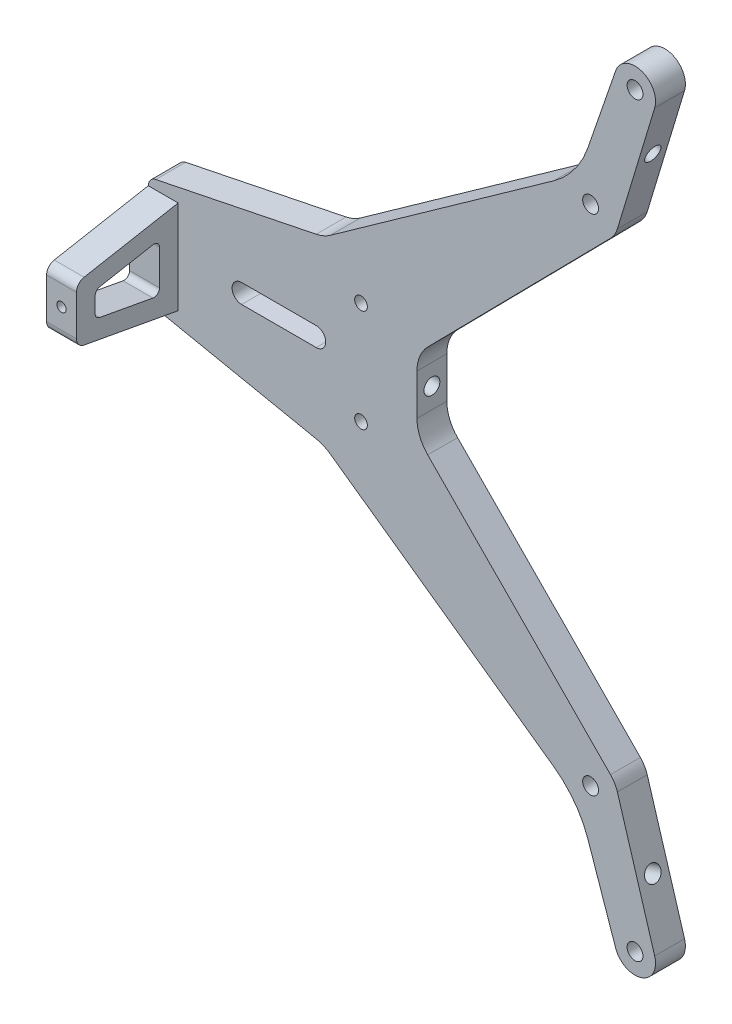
ISO-10303-21;
HEADER;
FILE_DESCRIPTION(('STEP AP214'),'2;1');
FILE_NAME('part.step','',(''),(''),'','','');
FILE_SCHEMA(('AUTOMOTIVE_DESIGN { 1 0 10303 214 1 1 1 1 }'));
ENDSEC;
DATA;
#1=APPLICATION_CONTEXT('core data for automotive mechanical design processes');
#2=APPLICATION_PROTOCOL_DEFINITION('international standard','automotive_design',2000,#1);
#3=PRODUCT_CONTEXT('',#1,'mechanical');
#4=PRODUCT('Part','Part','',(#3));
#5=PRODUCT_RELATED_PRODUCT_CATEGORY('part','',(#4));
#6=PRODUCT_DEFINITION_FORMATION('','',#4);
#7=PRODUCT_DEFINITION_CONTEXT('part definition',#1,'design');
#8=PRODUCT_DEFINITION('design','',#6,#7);
#9=PRODUCT_DEFINITION_SHAPE('','',#8);
#10=(LENGTH_UNIT() NAMED_UNIT(*) SI_UNIT(.MILLI.,.METRE.));
#11=(NAMED_UNIT(*) PLANE_ANGLE_UNIT() SI_UNIT($,.RADIAN.));
#12=(NAMED_UNIT(*) SI_UNIT($,.STERADIAN.) SOLID_ANGLE_UNIT());
#13=UNCERTAINTY_MEASURE_WITH_UNIT(LENGTH_MEASURE(1.E-05),#10,'distance_accuracy_value','');
#14=(GEOMETRIC_REPRESENTATION_CONTEXT(3) GLOBAL_UNCERTAINTY_ASSIGNED_CONTEXT((#13)) GLOBAL_UNIT_ASSIGNED_CONTEXT((#10,
#11,#12)) REPRESENTATION_CONTEXT('',''));
#15=CARTESIAN_POINT('',(0.,0.,0.));
#16=DIRECTION('',(0.,0.,1.));
#17=DIRECTION('',(1.,0.,0.));
#18=AXIS2_PLACEMENT_3D('',#15,#16,#17);
#19=CARTESIAN_POINT('',(-29.6774136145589,176.695818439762,8.));
#20=DIRECTION('',(0.,0.,-1.));
#21=DIRECTION('',(-1.,0.,0.));
#22=AXIS2_PLACEMENT_3D('',#19,#20,#21);
#23=PLANE('',#22);
#24=DIRECTION('',(1.,0.,0.));
#25=VECTOR('',#24,1.);
#26=CARTESIAN_POINT('',(-168.,-5.1,8.));
#27=LINE('',#26,#25);
#28=CARTESIAN_POINT('',(-168.,-5.1,8.));
#29=VERTEX_POINT('',#28);
#30=CARTESIAN_POINT('',(-128.,-5.1,8.));
#31=VERTEX_POINT('',#30);
#32=EDGE_CURVE('E665',#29,#31,#27,.T.);
#33=ORIENTED_EDGE('',*,*,#32,.F.);
#34=CARTESIAN_POINT('',(-168.,0.,8.));
#35=DIRECTION('',(0.,0.,1.));
#36=DIRECTION('',(1.,0.,0.));
#37=AXIS2_PLACEMENT_3D('',#34,#35,#36);
#38=CIRCLE('',#37,5.1);
#39=CARTESIAN_POINT('',(-168.,5.1,8.));
#40=VERTEX_POINT('',#39);
#41=EDGE_CURVE('E663',#40,#29,#38,.T.);
#42=ORIENTED_EDGE('',*,*,#41,.F.);
#43=DIRECTION('',(-1.,0.,0.));
#44=VECTOR('',#43,1.);
#45=CARTESIAN_POINT('',(-168.,5.1,8.));
#46=LINE('',#45,#44);
#47=CARTESIAN_POINT('',(-128.,5.1,8.));
#48=VERTEX_POINT('',#47);
#49=EDGE_CURVE('E671',#48,#40,#46,.T.);
#50=ORIENTED_EDGE('',*,*,#49,.F.);
#51=CARTESIAN_POINT('',(-128.,0.,8.));
#52=DIRECTION('',(0.,0.,1.));
#53=DIRECTION('',(1.,0.,0.));
#54=AXIS2_PLACEMENT_3D('',#51,#52,#53);
#55=CIRCLE('',#54,5.1);
#56=EDGE_CURVE('E668',#31,#48,#55,.T.);
#57=ORIENTED_EDGE('',*,*,#56,.F.);
#58=EDGE_LOOP('',(#33,#42,#50,#57));
#59=FACE_BOUND('',#58,.T.);
#60=CARTESIAN_POINT('',(42.8663122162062,-200.,8.));
#61=DIRECTION('',(0.,0.,1.));
#62=DIRECTION('',(1.,0.,0.));
#63=AXIS2_PLACEMENT_3D('',#60,#61,#62);
#64=CIRCLE('',#63,4.24999999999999);
#65=CARTESIAN_POINT('',(47.1163122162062,-200.,8.));
#66=VERTEX_POINT('',#65);
#67=EDGE_CURVE('E550',#66,#66,#64,.T.);
#68=ORIENTED_EDGE('',*,*,#67,.F.);
#69=EDGE_LOOP('',(#68));
#70=FACE_BOUND('',#69,.T.);
#71=CARTESIAN_POINT('',(42.8663122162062,200.,8.));
#72=DIRECTION('',(0.,0.,1.));
#73=DIRECTION('',(1.,0.,0.));
#74=AXIS2_PLACEMENT_3D('',#71,#72,#73);
#75=CIRCLE('',#74,4.24999999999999);
#76=CARTESIAN_POINT('',(47.1163122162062,200.,8.));
#77=VERTEX_POINT('',#76);
#78=EDGE_CURVE('E717',#77,#77,#75,.T.);
#79=ORIENTED_EDGE('',*,*,#78,.F.);
#80=EDGE_LOOP('',(#79));
#81=FACE_BOUND('',#80,.T.);
#82=CARTESIAN_POINT('',(-213.,25.,8.));
#83=DIRECTION('',(0.,0.,1.));
#84=DIRECTION('',(1.,0.,0.));
#85=AXIS2_PLACEMENT_3D('',#82,#83,#84);
#86=CIRCLE('',#85,5.);
#87=CARTESIAN_POINT('',(-214.002533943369,29.8984615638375,8.));
#88=VERTEX_POINT('',#87);
#89=CARTESIAN_POINT('',(-218.,25.0000000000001,8.00000000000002));
#90=VERTEX_POINT('',#89);
#91=EDGE_CURVE('E375',#88,#90,#86,.T.);
#92=ORIENTED_EDGE('',*,*,#91,.T.);
#93=DIRECTION('',(-1.,0.,0.));
#94=VECTOR('',#93,1.);
#95=CARTESIAN_POINT('',(-119.597026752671,25.0000000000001,8.00000000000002));
#96=LINE('',#95,#94);
#97=CARTESIAN_POINT('',(-202.,25.0000000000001,8.00000000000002));
#98=VERTEX_POINT('',#97);
#99=EDGE_CURVE('E609',#98,#90,#96,.T.);
#100=ORIENTED_EDGE('',*,*,#99,.F.);
#101=DIRECTION('',(0.,-1.,0.));
#102=VECTOR('',#101,1.);
#103=CARTESIAN_POINT('',(-202.,15.,8.));
#104=LINE('',#103,#102);
#105=CARTESIAN_POINT('',(-202.,-25.0000000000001,8.00000000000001));
#106=VERTEX_POINT('',#105);
#107=EDGE_CURVE('E352',#98,#106,#104,.T.);
#108=ORIENTED_EDGE('',*,*,#107,.T.);
#109=DIRECTION('',(-1.,0.,0.));
#110=VECTOR('',#109,1.);
#111=CARTESIAN_POINT('',(-119.597026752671,-25.0000000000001,8.00000000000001));
#112=LINE('',#111,#110);
#113=CARTESIAN_POINT('',(-218.,-25.0000000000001,8.00000000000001));
#114=VERTEX_POINT('',#113);
#115=EDGE_CURVE('E337',#106,#114,#112,.T.);
#116=ORIENTED_EDGE('',*,*,#115,.T.);
#117=CARTESIAN_POINT('',(-213.,-25.,8.));
#118=DIRECTION('',(0.,0.,1.));
#119=DIRECTION('',(-1.,0.,0.));
#120=AXIS2_PLACEMENT_3D('',#117,#118,#119);
#121=CIRCLE('',#120,5.);
#122=CARTESIAN_POINT('',(-214.002533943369,-29.8984615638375,8.));
#123=VERTEX_POINT('',#122);
#124=EDGE_CURVE('E348',#114,#123,#121,.T.);
#125=ORIENTED_EDGE('',*,*,#124,.T.);
#126=DIRECTION('',(0.979692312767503,-0.200506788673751,0.));
#127=VECTOR('',#126,1.);
#128=CARTESIAN_POINT('',(-214.002533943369,-29.8984615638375,8.));
#129=LINE('',#128,#127);
#130=CARTESIAN_POINT('',(-128.,-47.5,8.));
#131=VERTEX_POINT('',#130);
#132=EDGE_CURVE('E371',#123,#131,#129,.T.);
#133=ORIENTED_EDGE('',*,*,#132,.T.);
#134=CARTESIAN_POINT('',(-132.010135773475,-67.0938462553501,8.));
#135=DIRECTION('',(0.,0.,-1.));
#136=DIRECTION('',(1.,0.,0.));
#137=AXIS2_PLACEMENT_3D('',#134,#135,#136);
#138=CIRCLE('',#137,20.);
#139=CARTESIAN_POINT('',(-120.417833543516,-50.7960387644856,8.));
#140=VERTEX_POINT('',#139);
#141=EDGE_CURVE('E373',#131,#140,#138,.T.);
#142=ORIENTED_EDGE('',*,*,#141,.T.);
#143=DIRECTION('',(0.814890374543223,-0.579615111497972,0.));
#144=VECTOR('',#143,1.);
#145=CARTESIAN_POINT('',(-120.417833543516,-50.7960387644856,8.));
#146=LINE('',#145,#144);
#147=CARTESIAN_POINT('',(-0.696658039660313,-135.951299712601,8.));
#148=VERTEX_POINT('',#147);
#149=EDGE_CURVE('E380',#140,#148,#146,.T.);
#150=ORIENTED_EDGE('',*,*,#149,.T.);
#151=CARTESIAN_POINT('',(-29.6774136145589,-176.695818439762,8.));
#152=DIRECTION('',(0.,0.,-1.));
#153=DIRECTION('',(1.,0.,0.));
#154=AXIS2_PLACEMENT_3D('',#151,#152,#153);
#155=CIRCLE('',#154,50.);
#156=CARTESIAN_POINT('',(17.5969671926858,-160.412915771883,8.));
#157=VERTEX_POINT('',#156);
#158=EDGE_CURVE('E382',#148,#157,#155,.T.);
#159=ORIENTED_EDGE('',*,*,#158,.T.);
#160=DIRECTION('',(0.325658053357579,-0.945487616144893,0.));
#161=VECTOR('',#160,1.);
#162=CARTESIAN_POINT('',(17.5969671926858,-160.412915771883,8.));
#163=LINE('',#162,#161);
#164=CARTESIAN_POINT('',(32.4659484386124,-203.582238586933,8.));
#165=VERTEX_POINT('',#164);
#166=EDGE_CURVE('E384',#157,#165,#163,.T.);
#167=ORIENTED_EDGE('',*,*,#166,.T.);
#168=CARTESIAN_POINT('',(42.8663122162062,-200.,8.));
#169=DIRECTION('',(0.,0.,1.));
#170=DIRECTION('',(-1.,0.,0.));
#171=AXIS2_PLACEMENT_3D('',#168,#169,#170);
#172=CIRCLE('',#171,11.);
#173=CARTESIAN_POINT('',(53.3960096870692,-196.817945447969,8.));
#174=VERTEX_POINT('',#173);
#175=EDGE_CURVE('E386',#165,#174,#172,.T.);
#176=ORIENTED_EDGE('',*,*,#175,.T.);
#177=DIRECTION('',(-0.289277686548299,0.957245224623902,0.));
#178=VECTOR('',#177,1.);
#179=CARTESIAN_POINT('',(33.4034566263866,-130.660834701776,8.));
#180=LINE('',#179,#178);
#181=CARTESIAN_POINT('',(33.4034566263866,-130.660834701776,8.));
#182=VERTEX_POINT('',#181);
#183=EDGE_CURVE('E388',#174,#182,#180,.T.);
#184=ORIENTED_EDGE('',*,*,#183,.T.);
#185=CARTESIAN_POINT('',(19.044778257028,-135.,8.));
#186=DIRECTION('',(0.,0.,1.));
#187=DIRECTION('',(-1.,0.,0.));
#188=AXIS2_PLACEMENT_3D('',#185,#186,#187);
#189=CIRCLE('',#188,15.);
#190=CARTESIAN_POINT('',(29.7294835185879,-124.47208123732,8.));
#191=VERTEX_POINT('',#190);
#192=EDGE_CURVE('E390',#182,#191,#189,.T.);
#193=ORIENTED_EDGE('',*,*,#192,.T.);
#194=DIRECTION('',(-0.70186125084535,0.712313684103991,0.));
#195=VECTOR('',#194,1.);
#196=CARTESIAN_POINT('',(-68.2462736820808,-25.037225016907,8.));
#197=LINE('',#196,#195);
#198=CARTESIAN_POINT('',(-68.2462736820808,-25.037225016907,8.));
#199=VERTEX_POINT('',#198);
#200=EDGE_CURVE('E392',#191,#199,#197,.T.);
#201=ORIENTED_EDGE('',*,*,#200,.T.);
#202=CARTESIAN_POINT('',(-54.000000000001,-11.,8.));
#203=DIRECTION('',(0.,0.,-1.));
#204=DIRECTION('',(1.,0.,0.));
#205=AXIS2_PLACEMENT_3D('',#202,#203,#204);
#206=CIRCLE('',#205,20.);
#207=CARTESIAN_POINT('',(-74.000000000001,-11.,8.));
#208=VERTEX_POINT('',#207);
#209=EDGE_CURVE('E394',#199,#208,#206,.T.);
#210=ORIENTED_EDGE('',*,*,#209,.T.);
#211=DIRECTION('',(0.,1.,0.));
#212=VECTOR('',#211,1.);
#213=CARTESIAN_POINT('',(-74.000000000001,11.,8.));
#214=LINE('',#213,#212);
#215=CARTESIAN_POINT('',(-74.000000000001,11.,8.));
#216=VERTEX_POINT('',#215);
#217=EDGE_CURVE('E396',#208,#216,#214,.T.);
#218=ORIENTED_EDGE('',*,*,#217,.T.);
#219=CARTESIAN_POINT('',(-54.000000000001,11.,8.));
#220=DIRECTION('',(0.,0.,-1.));
#221=DIRECTION('',(-1.,0.,0.));
#222=AXIS2_PLACEMENT_3D('',#219,#220,#221);
#223=CIRCLE('',#222,20.);
#224=CARTESIAN_POINT('',(-68.2462736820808,25.037225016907,8.));
#225=VERTEX_POINT('',#224);
#226=EDGE_CURVE('E398',#216,#225,#223,.T.);
#227=ORIENTED_EDGE('',*,*,#226,.T.);
#228=DIRECTION('',(0.70186125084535,0.712313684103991,0.));
#229=VECTOR('',#228,1.);
#230=CARTESIAN_POINT('',(-68.2462736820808,25.037225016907,8.));
#231=LINE('',#230,#229);
#232=CARTESIAN_POINT('',(29.7294835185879,124.47208123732,8.));
#233=VERTEX_POINT('',#232);
#234=EDGE_CURVE('E400',#225,#233,#231,.T.);
#235=ORIENTED_EDGE('',*,*,#234,.T.);
#236=CARTESIAN_POINT('',(19.044778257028,135.,8.));
#237=DIRECTION('',(0.,0.,1.));
#238=DIRECTION('',(1.,0.,0.));
#239=AXIS2_PLACEMENT_3D('',#236,#237,#238);
#240=CIRCLE('',#239,15.);
#241=CARTESIAN_POINT('',(33.4034566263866,130.660834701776,8.));
#242=VERTEX_POINT('',#241);
#243=EDGE_CURVE('E402',#233,#242,#240,.T.);
#244=ORIENTED_EDGE('',*,*,#243,.T.);
#245=DIRECTION('',(0.289277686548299,0.957245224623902,0.));
#246=VECTOR('',#245,1.);
#247=CARTESIAN_POINT('',(33.4034566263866,130.660834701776,8.));
#248=LINE('',#247,#246);
#249=CARTESIAN_POINT('',(53.3960096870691,196.817945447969,8.));
#250=VERTEX_POINT('',#249);
#251=EDGE_CURVE('E404',#242,#250,#248,.T.);
#252=ORIENTED_EDGE('',*,*,#251,.T.);
#253=CARTESIAN_POINT('',(42.8663122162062,200.,8.));
#254=DIRECTION('',(0.,0.,1.));
#255=DIRECTION('',(1.,0.,0.));
#256=AXIS2_PLACEMENT_3D('',#253,#254,#255);
#257=CIRCLE('',#256,11.);
#258=CARTESIAN_POINT('',(32.4659484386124,203.582238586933,8.));
#259=VERTEX_POINT('',#258);
#260=EDGE_CURVE('E406',#250,#259,#257,.T.);
#261=ORIENTED_EDGE('',*,*,#260,.T.);
#262=DIRECTION('',(-0.325658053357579,-0.945487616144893,0.));
#263=VECTOR('',#262,1.);
#264=CARTESIAN_POINT('',(17.5969671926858,160.412915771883,8.));
#265=LINE('',#264,#263);
#266=CARTESIAN_POINT('',(17.5969671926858,160.412915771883,8.));
#267=VERTEX_POINT('',#266);
#268=EDGE_CURVE('E408',#259,#267,#265,.T.);
#269=ORIENTED_EDGE('',*,*,#268,.T.);
#270=CARTESIAN_POINT('',(-29.6774136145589,176.695818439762,8.));
#271=DIRECTION('',(0.,0.,-1.));
#272=DIRECTION('',(-1.,0.,0.));
#273=AXIS2_PLACEMENT_3D('',#270,#271,#272);
#274=CIRCLE('',#273,50.);
#275=CARTESIAN_POINT('',(-0.696658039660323,135.951299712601,8.));
#276=VERTEX_POINT('',#275);
#277=EDGE_CURVE('E472',#267,#276,#274,.T.);
#278=ORIENTED_EDGE('',*,*,#277,.T.);
#279=DIRECTION('',(-0.814890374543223,-0.579615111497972,0.));
#280=VECTOR('',#279,1.);
#281=CARTESIAN_POINT('',(-120.417833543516,50.7960387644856,8.));
#282=LINE('',#281,#280);
#283=CARTESIAN_POINT('',(-120.417833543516,50.7960387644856,8.));
#284=VERTEX_POINT('',#283);
#285=EDGE_CURVE('E736',#276,#284,#282,.T.);
#286=ORIENTED_EDGE('',*,*,#285,.T.);
#287=CARTESIAN_POINT('',(-132.010135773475,67.0938462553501,8.));
#288=DIRECTION('',(0.,0.,-1.));
#289=DIRECTION('',(-1.,0.,0.));
#290=AXIS2_PLACEMENT_3D('',#287,#288,#289);
#291=CIRCLE('',#290,20.);
#292=CARTESIAN_POINT('',(-128.,47.5,8.));
#293=VERTEX_POINT('',#292);
#294=EDGE_CURVE('E738',#284,#293,#291,.T.);
#295=ORIENTED_EDGE('',*,*,#294,.T.);
#296=DIRECTION('',(-0.979692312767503,-0.200506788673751,0.));
#297=VECTOR('',#296,1.);
#298=CARTESIAN_POINT('',(-214.002533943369,29.8984615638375,8.));
#299=LINE('',#298,#297);
#300=EDGE_CURVE('E740',#293,#88,#299,.T.);
#301=ORIENTED_EDGE('',*,*,#300,.T.);
#302=EDGE_LOOP('',(#92,#100,#108,#116,#125,#133,#142,#150,#159,#167,#176,#184,#193,#201,#210,
#218,#227,#235,#244,#252,#261,#269,#278,#286,#295,#301));
#303=FACE_BOUND('',#302,.T.);
#304=CARTESIAN_POINT('',(19.044778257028,135.,8.));
#305=DIRECTION('',(0.,0.,1.));
#306=DIRECTION('',(1.,0.,0.));
#307=AXIS2_PLACEMENT_3D('',#304,#305,#306);
#308=CIRCLE('',#307,4.24999999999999);
#309=CARTESIAN_POINT('',(23.294778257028,135.,8.));
#310=VERTEX_POINT('',#309);
#311=EDGE_CURVE('E723',#310,#310,#308,.T.);
#312=ORIENTED_EDGE('',*,*,#311,.F.);
#313=EDGE_LOOP('',(#312));
#314=FACE_BOUND('',#313,.T.);
#315=CARTESIAN_POINT('',(-104.,27.5,8.));
#316=DIRECTION('',(0.,0.,1.));
#317=DIRECTION('',(1.,0.,0.));
#318=AXIS2_PLACEMENT_3D('',#315,#316,#317);
#319=CIRCLE('',#318,3.4);
#320=CARTESIAN_POINT('',(-100.6,27.5,8.));
#321=VERTEX_POINT('',#320);
#322=EDGE_CURVE('E711',#321,#321,#319,.T.);
#323=ORIENTED_EDGE('',*,*,#322,.F.);
#324=EDGE_LOOP('',(#323));
#325=FACE_BOUND('',#324,.T.);
#326=CARTESIAN_POINT('',(19.044778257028,-135.,8.));
#327=DIRECTION('',(0.,0.,1.));
#328=DIRECTION('',(1.,0.,0.));
#329=AXIS2_PLACEMENT_3D('',#326,#327,#328);
#330=CIRCLE('',#329,4.24999999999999);
#331=CARTESIAN_POINT('',(23.294778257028,-135.,8.));
#332=VERTEX_POINT('',#331);
#333=EDGE_CURVE('E699',#332,#332,#330,.T.);
#334=ORIENTED_EDGE('',*,*,#333,.F.);
#335=EDGE_LOOP('',(#334));
#336=FACE_BOUND('',#335,.T.);
#337=CARTESIAN_POINT('',(-104.,-27.5,8.));
#338=DIRECTION('',(0.,0.,1.));
#339=DIRECTION('',(1.,0.,0.));
#340=AXIS2_PLACEMENT_3D('',#337,#338,#339);
#341=CIRCLE('',#340,3.4);
#342=CARTESIAN_POINT('',(-100.6,-27.5,8.));
#343=VERTEX_POINT('',#342);
#344=EDGE_CURVE('E551',#343,#343,#341,.T.);
#345=ORIENTED_EDGE('',*,*,#344,.F.);
#346=EDGE_LOOP('',(#345));
#347=FACE_BOUND('',#346,.T.);
#348=ADVANCED_FACE('F41',(#59,#70,#81,#303,#314,#325,#336,#347),#23,.F.);
#349=CARTESIAN_POINT('',(-29.6774136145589,176.695818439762,8.));
#350=DIRECTION('',(0.,0.,-1.));
#351=DIRECTION('',(-1.,0.,0.));
#352=AXIS2_PLACEMENT_3D('',#349,#350,#351);
#353=CYLINDRICAL_SURFACE('',#352,50.);
#354=CARTESIAN_POINT('',(-29.6774136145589,176.695818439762,-8.));
#355=DIRECTION('',(0.,0.,-1.));
#356=DIRECTION('',(-1.,0.,0.));
#357=AXIS2_PLACEMENT_3D('',#354,#355,#356);
#358=CIRCLE('',#357,50.);
#359=CARTESIAN_POINT('',(17.5969671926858,160.412915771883,-8.));
#360=VERTEX_POINT('',#359);
#361=CARTESIAN_POINT('',(-0.696658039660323,135.951299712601,-8.));
#362=VERTEX_POINT('',#361);
#363=EDGE_CURVE('E411',#360,#362,#358,.T.);
#364=ORIENTED_EDGE('',*,*,#363,.T.);
#365=DIRECTION('',(0.,0.,-1.));
#366=VECTOR('',#365,1.);
#367=CARTESIAN_POINT('',(-0.696658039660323,135.951299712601,8.));
#368=LINE('',#367,#366);
#369=EDGE_CURVE('E543',#276,#362,#368,.T.);
#370=ORIENTED_EDGE('',*,*,#369,.F.);
#371=ORIENTED_EDGE('',*,*,#277,.F.);
#372=DIRECTION('',(0.,0.,-1.));
#373=VECTOR('',#372,1.);
#374=CARTESIAN_POINT('',(17.5969671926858,160.412915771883,8.));
#375=LINE('',#374,#373);
#376=EDGE_CURVE('E410',#267,#360,#375,.T.);
#377=ORIENTED_EDGE('',*,*,#376,.T.);
#378=EDGE_LOOP('',(#364,#370,#371,#377));
#379=FACE_BOUND('',#378,.T.);
#380=ADVANCED_FACE('F855',(#379),#353,.F.);
#381=CARTESIAN_POINT('',(-120.417833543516,50.7960387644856,8.));
#382=DIRECTION('',(0.579615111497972,-0.814890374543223,0.));
#383=DIRECTION('',(0.814890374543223,0.579615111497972,0.));
#384=AXIS2_PLACEMENT_3D('',#381,#382,#383);
#385=PLANE('',#384);
#386=DIRECTION('',(-0.814890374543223,-0.579615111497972,0.));
#387=VECTOR('',#386,1.);
#388=CARTESIAN_POINT('',(-120.417833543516,50.7960387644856,-8.));
#389=LINE('',#388,#387);
#390=CARTESIAN_POINT('',(-120.417833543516,50.7960387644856,-8.));
#391=VERTEX_POINT('',#390);
#392=EDGE_CURVE('E414',#362,#391,#389,.T.);
#393=ORIENTED_EDGE('',*,*,#392,.T.);
#394=DIRECTION('',(0.,0.,-1.));
#395=VECTOR('',#394,1.);
#396=CARTESIAN_POINT('',(-120.417833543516,50.7960387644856,8.));
#397=LINE('',#396,#395);
#398=EDGE_CURVE('E540',#284,#391,#397,.T.);
#399=ORIENTED_EDGE('',*,*,#398,.F.);
#400=ORIENTED_EDGE('',*,*,#285,.F.);
#401=ORIENTED_EDGE('',*,*,#369,.T.);
#402=EDGE_LOOP('',(#393,#399,#400,#401));
#403=FACE_BOUND('',#402,.T.);
#404=ADVANCED_FACE('F857',(#403),#385,.F.);
#405=CARTESIAN_POINT('',(-132.010135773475,67.0938462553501,8.));
#406=DIRECTION('',(0.,0.,-1.));
#407=DIRECTION('',(-1.,0.,0.));
#408=AXIS2_PLACEMENT_3D('',#405,#406,#407);
#409=CYLINDRICAL_SURFACE('',#408,20.);
#410=CARTESIAN_POINT('',(-132.010135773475,67.0938462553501,-8.));
#411=DIRECTION('',(0.,0.,-1.));
#412=DIRECTION('',(-1.,0.,0.));
#413=AXIS2_PLACEMENT_3D('',#410,#411,#412);
#414=CIRCLE('',#413,20.);
#415=CARTESIAN_POINT('',(-128.,47.5,-8.));
#416=VERTEX_POINT('',#415);
#417=EDGE_CURVE('E417',#391,#416,#414,.T.);
#418=ORIENTED_EDGE('',*,*,#417,.T.);
#419=DIRECTION('',(0.,0.,-1.));
#420=VECTOR('',#419,1.);
#421=CARTESIAN_POINT('',(-128.,47.5,8.));
#422=LINE('',#421,#420);
#423=EDGE_CURVE('E537',#293,#416,#422,.T.);
#424=ORIENTED_EDGE('',*,*,#423,.F.);
#425=ORIENTED_EDGE('',*,*,#294,.F.);
#426=ORIENTED_EDGE('',*,*,#398,.T.);
#427=EDGE_LOOP('',(#418,#424,#425,#426));
#428=FACE_BOUND('',#427,.T.);
#429=ADVANCED_FACE('F862',(#428),#409,.F.);
#430=CARTESIAN_POINT('',(-214.002533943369,29.8984615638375,8.));
#431=DIRECTION('',(0.200506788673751,-0.979692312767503,0.));
#432=DIRECTION('',(0.979692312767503,0.200506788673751,0.));
#433=AXIS2_PLACEMENT_3D('',#430,#431,#432);
#434=PLANE('',#433);
#435=DIRECTION('',(-0.979692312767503,-0.200506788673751,0.));
#436=VECTOR('',#435,1.);
#437=CARTESIAN_POINT('',(-214.002533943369,29.8984615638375,-8.));
#438=LINE('',#437,#436);
#439=CARTESIAN_POINT('',(-214.002533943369,29.8984615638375,-8.));
#440=VERTEX_POINT('',#439);
#441=EDGE_CURVE('E419',#416,#440,#438,.T.);
#442=ORIENTED_EDGE('',*,*,#441,.T.);
#443=DIRECTION('',(0.,0.,-1.));
#444=VECTOR('',#443,1.);
#445=CARTESIAN_POINT('',(-214.002533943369,29.8984615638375,8.));
#446=LINE('',#445,#444);
#447=EDGE_CURVE('E534',#88,#440,#446,.T.);
#448=ORIENTED_EDGE('',*,*,#447,.F.);
#449=ORIENTED_EDGE('',*,*,#300,.F.);
#450=ORIENTED_EDGE('',*,*,#423,.T.);
#451=EDGE_LOOP('',(#442,#448,#449,#450));
#452=FACE_BOUND('',#451,.T.);
#453=ADVANCED_FACE('F865',(#452),#434,.F.);
#454=CARTESIAN_POINT('',(-213.,25.,8.));
#455=DIRECTION('',(0.,0.,-1.));
#456=DIRECTION('',(-1.,0.,0.));
#457=AXIS2_PLACEMENT_3D('',#454,#455,#456);
#458=CYLINDRICAL_SURFACE('',#457,5.);
#459=CARTESIAN_POINT('',(-213.,25.,-8.));
#460=DIRECTION('',(0.,0.,1.));
#461=DIRECTION('',(1.,0.,0.));
#462=AXIS2_PLACEMENT_3D('',#459,#460,#461);
#463=CIRCLE('',#462,5.);
#464=CARTESIAN_POINT('',(-218.,25.,-8.));
#465=VERTEX_POINT('',#464);
#466=EDGE_CURVE('E421',#440,#465,#463,.T.);
#467=ORIENTED_EDGE('',*,*,#466,.T.);
#468=DIRECTION('',(0.,0.,-1.));
#469=VECTOR('',#468,1.);
#470=CARTESIAN_POINT('',(-218.,25.,8.));
#471=LINE('',#470,#469);
#472=EDGE_CURVE('E531',#90,#465,#471,.T.);
#473=ORIENTED_EDGE('',*,*,#472,.F.);
#474=ORIENTED_EDGE('',*,*,#91,.F.);
#475=ORIENTED_EDGE('',*,*,#447,.T.);
#476=EDGE_LOOP('',(#467,#473,#474,#475));
#477=FACE_BOUND('',#476,.T.);
#478=ADVANCED_FACE('F746',(#477),#458,.T.);
#479=CARTESIAN_POINT('',(-218.,15.,8.));
#480=DIRECTION('',(0.,1.,0.));
#481=DIRECTION('',(0.,0.,1.));
#482=AXIS2_PLACEMENT_3D('',#479,#480,#481);
#483=PLANE('',#482);
#484=DIRECTION('',(0.,0.,-1.));
#485=VECTOR('',#484,1.);
#486=CARTESIAN_POINT('',(-202.,15.,8.));
#487=LINE('',#486,#485);
#488=CARTESIAN_POINT('',(-202.,14.9999999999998,-3.00000000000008));
#489=VERTEX_POINT('',#488);
#490=CARTESIAN_POINT('',(-202.,15.,-8.));
#491=VERTEX_POINT('',#490);
#492=EDGE_CURVE('E527',#489,#491,#487,.T.);
#493=ORIENTED_EDGE('',*,*,#492,.F.);
#494=DIRECTION('',(-1.,0.,0.));
#495=VECTOR('',#494,1.);
#496=CARTESIAN_POINT('',(-119.597026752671,14.9999999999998,-3.00000000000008));
#497=LINE('',#496,#495);
#498=CARTESIAN_POINT('',(-218.,14.9999999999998,-3.00000000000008));
#499=VERTEX_POINT('',#498);
#500=EDGE_CURVE('E647',#489,#499,#497,.T.);
#501=ORIENTED_EDGE('',*,*,#500,.T.);
#502=DIRECTION('',(0.,0.,-1.));
#503=VECTOR('',#502,1.);
#504=CARTESIAN_POINT('',(-218.,15.,8.));
#505=LINE('',#504,#503);
#506=CARTESIAN_POINT('',(-218.,15.,-8.));
#507=VERTEX_POINT('',#506);
#508=EDGE_CURVE('E529',#499,#507,#505,.T.);
#509=ORIENTED_EDGE('',*,*,#508,.T.);
#510=DIRECTION('',(1.,0.,0.));
#511=VECTOR('',#510,1.);
#512=CARTESIAN_POINT('',(-218.,15.,-8.));
#513=LINE('',#512,#511);
#514=EDGE_CURVE('E426',#507,#491,#513,.T.);
#515=ORIENTED_EDGE('',*,*,#514,.T.);
#516=EDGE_LOOP('',(#493,#501,#509,#515));
#517=FACE_BOUND('',#516,.T.);
#518=ADVANCED_FACE('F759',(#517),#483,.F.);
#519=CARTESIAN_POINT('',(-202.,15.,8.));
#520=DIRECTION('',(1.,0.,0.));
#521=DIRECTION('',(0.,0.,-1.));
#522=AXIS2_PLACEMENT_3D('',#519,#520,#521);
#523=PLANE('',#522);
#524=DIRECTION('',(0.,0.,-1.));
#525=VECTOR('',#524,1.);
#526=CARTESIAN_POINT('',(-202.,-15.,8.));
#527=LINE('',#526,#525);
#528=CARTESIAN_POINT('',(-202.,-15.0000000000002,-3.));
#529=VERTEX_POINT('',#528);
#530=CARTESIAN_POINT('',(-202.,-15.,-8.));
#531=VERTEX_POINT('',#530);
#532=EDGE_CURVE('E525',#529,#531,#527,.T.);
#533=ORIENTED_EDGE('',*,*,#532,.F.);
#534=DIRECTION('',(0.,-1.,0.));
#535=VECTOR('',#534,1.);
#536=CARTESIAN_POINT('',(-202.,-15.0000000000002,-3.));
#537=LINE('',#536,#535);
#538=EDGE_CURVE('E353',#489,#529,#537,.T.);
#539=ORIENTED_EDGE('',*,*,#538,.F.);
#540=ORIENTED_EDGE('',*,*,#492,.T.);
#541=DIRECTION('',(0.,-1.,0.));
#542=VECTOR('',#541,1.);
#543=CARTESIAN_POINT('',(-202.,15.,-8.));
#544=LINE('',#543,#542);
#545=EDGE_CURVE('E429',#491,#531,#544,.T.);
#546=ORIENTED_EDGE('',*,*,#545,.T.);
#547=EDGE_LOOP('',(#533,#539,#540,#546));
#548=FACE_BOUND('',#547,.T.);
#549=ADVANCED_FACE('F935',(#548),#523,.F.);
#550=CARTESIAN_POINT('',(-218.,-15.,8.));
#551=DIRECTION('',(0.,-1.,0.));
#552=DIRECTION('',(0.,0.,-1.));
#553=AXIS2_PLACEMENT_3D('',#550,#551,#552);
#554=PLANE('',#553);
#555=DIRECTION('',(0.,0.,-1.));
#556=VECTOR('',#555,1.);
#557=CARTESIAN_POINT('',(-218.,-15.,8.));
#558=LINE('',#557,#556);
#559=CARTESIAN_POINT('',(-218.,-15.,-3.));
#560=VERTEX_POINT('',#559);
#561=CARTESIAN_POINT('',(-218.,-15.,-8.));
#562=VERTEX_POINT('',#561);
#563=EDGE_CURVE('E365',#560,#562,#558,.T.);
#564=ORIENTED_EDGE('',*,*,#563,.F.);
#565=DIRECTION('',(-1.,0.,0.));
#566=VECTOR('',#565,1.);
#567=CARTESIAN_POINT('',(-119.597026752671,-15.0000000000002,-3.));
#568=LINE('',#567,#566);
#569=EDGE_CURVE('E645',#529,#560,#568,.T.);
#570=ORIENTED_EDGE('',*,*,#569,.F.);
#571=ORIENTED_EDGE('',*,*,#532,.T.);
#572=DIRECTION('',(-1.,0.,0.));
#573=VECTOR('',#572,1.);
#574=CARTESIAN_POINT('',(-218.,-15.,-8.));
#575=LINE('',#574,#573);
#576=EDGE_CURVE('E432',#531,#562,#575,.T.);
#577=ORIENTED_EDGE('',*,*,#576,.T.);
#578=EDGE_LOOP('',(#564,#570,#571,#577));
#579=FACE_BOUND('',#578,.T.);
#580=ADVANCED_FACE('F767',(#579),#554,.F.);
#581=CARTESIAN_POINT('',(-218.,-25.,8.));
#582=DIRECTION('',(1.,0.,0.));
#583=DIRECTION('',(0.,0.,-1.));
#584=AXIS2_PLACEMENT_3D('',#581,#582,#583);
#585=PLANE('',#584);
#586=DIRECTION('',(0.,1.,0.));
#587=VECTOR('',#586,1.);
#588=CARTESIAN_POINT('',(-218.,-15.,62.5000000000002));
#589=LINE('',#588,#587);
#590=CARTESIAN_POINT('',(-218.,-10.8339599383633,62.5000000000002));
#591=VERTEX_POINT('',#590);
#592=CARTESIAN_POINT('',(-218.,10.8339599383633,62.5000000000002));
#593=VERTEX_POINT('',#592);
#594=EDGE_CURVE('E341',#591,#593,#589,.T.);
#595=ORIENTED_EDGE('',*,*,#594,.T.);
#596=CARTESIAN_POINT('',(-218.,10.8339599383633,57.5000000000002));
#597=DIRECTION('',(1.,0.,0.));
#598=DIRECTION('',(0.,0.,-1.));
#599=AXIS2_PLACEMENT_3D('',#596,#597,#598);
#600=CIRCLE('',#599,5.);
#601=CARTESIAN_POINT('',(-218.,15.7518592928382,58.4023668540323));
#602=VERTEX_POINT('',#601);
#603=EDGE_CURVE('E594',#593,#602,#600,.F.);
#604=ORIENTED_EDGE('',*,*,#603,.T.);
#605=DIRECTION('',(0.,0.180473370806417,-0.983579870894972));
#606=VECTOR('',#605,1.);
#607=CARTESIAN_POINT('',(-218.,15.,62.5000000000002));
#608=LINE('',#607,#606);
#609=EDGE_CURVE('E612',#602,#90,#608,.T.);
#610=ORIENTED_EDGE('',*,*,#609,.T.);
#611=ORIENTED_EDGE('',*,*,#472,.T.);
#612=DIRECTION('',(0.,-1.,0.));
#613=VECTOR('',#612,1.);
#614=CARTESIAN_POINT('',(-218.,25.,-8.));
#615=LINE('',#614,#613);
#616=EDGE_CURVE('E423',#465,#507,#615,.T.);
#617=ORIENTED_EDGE('',*,*,#616,.T.);
#618=ORIENTED_EDGE('',*,*,#508,.F.);
#619=DIRECTION('',(0.,-1.,0.));
#620=VECTOR('',#619,1.);
#621=CARTESIAN_POINT('',(-218.,-15.0000000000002,-3.));
#622=LINE('',#621,#620);
#623=EDGE_CURVE('E615',#499,#560,#622,.T.);
#624=ORIENTED_EDGE('',*,*,#623,.T.);
#625=ORIENTED_EDGE('',*,*,#563,.T.);
#626=DIRECTION('',(0.,-1.,0.));
#627=VECTOR('',#626,1.);
#628=CARTESIAN_POINT('',(-218.,-25.,-8.));
#629=LINE('',#628,#627);
#630=CARTESIAN_POINT('',(-218.,-25.,-8.));
#631=VERTEX_POINT('',#630);
#632=EDGE_CURVE('E362',#562,#631,#629,.T.);
#633=ORIENTED_EDGE('',*,*,#632,.T.);
#634=DIRECTION('',(0.,0.,-1.));
#635=VECTOR('',#634,1.);
#636=CARTESIAN_POINT('',(-218.,-25.,8.));
#637=LINE('',#636,#635);
#638=EDGE_CURVE('E357',#114,#631,#637,.T.);
#639=ORIENTED_EDGE('',*,*,#638,.F.);
#640=DIRECTION('',(0.,0.180473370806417,0.983579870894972));
#641=VECTOR('',#640,1.);
#642=CARTESIAN_POINT('',(-218.,-25.0000000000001,8.00000000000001));
#643=LINE('',#642,#641);
#644=CARTESIAN_POINT('',(-218.,-15.7518592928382,58.4023668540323));
#645=VERTEX_POINT('',#644);
#646=EDGE_CURVE('E334',#114,#645,#643,.T.);
#647=ORIENTED_EDGE('',*,*,#646,.T.);
#648=CARTESIAN_POINT('',(-218.,-10.8339599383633,57.5000000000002));
#649=DIRECTION('',(1.,0.,0.));
#650=DIRECTION('',(0.,0.,-1.));
#651=AXIS2_PLACEMENT_3D('',#648,#649,#650);
#652=CIRCLE('',#651,5.);
#653=EDGE_CURVE('E592',#645,#591,#652,.F.);
#654=ORIENTED_EDGE('',*,*,#653,.T.);
#655=EDGE_LOOP('',(#595,#604,#610,#611,#617,#618,#624,#625,#633,#639,#647,#654));
#656=FACE_BOUND('',#655,.T.);
#657=DIRECTION('',(0.,0.180473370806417,0.983579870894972));
#658=VECTOR('',#657,1.);
#659=CARTESIAN_POINT('',(-218.,-6.66791987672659,52.5));
#660=LINE('',#659,#658);
#661=CARTESIAN_POINT('',(-218.,-12.3483932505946,21.5414201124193));
#662=VERTEX_POINT('',#661);
#663=CARTESIAN_POINT('',(-218.,-7.11903545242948,50.0414201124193));
#664=VERTEX_POINT('',#663);
#665=EDGE_CURVE('E608',#662,#664,#660,.T.);
#666=ORIENTED_EDGE('',*,*,#665,.F.);
#667=CARTESIAN_POINT('',(-218.,-9.3976536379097,21.));
#668=DIRECTION('',(1.,0.,0.));
#669=DIRECTION('',(0.,0.,-1.));
#670=AXIS2_PLACEMENT_3D('',#667,#668,#669);
#671=CIRCLE('',#670,3.);
#672=CARTESIAN_POINT('',(-218.,-9.3976536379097,18.));
#673=VERTEX_POINT('',#672);
#674=EDGE_CURVE('E571',#662,#673,#671,.T.);
#675=ORIENTED_EDGE('',*,*,#674,.T.);
#676=DIRECTION('',(0.,-1.,0.));
#677=VECTOR('',#676,1.);
#678=CARTESIAN_POINT('',(-218.,-12.9981951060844,18.));
#679=LINE('',#678,#677);
#680=CARTESIAN_POINT('',(-218.,9.39765363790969,18.));
#681=VERTEX_POINT('',#680);
#682=EDGE_CURVE('E622',#681,#673,#679,.T.);
#683=ORIENTED_EDGE('',*,*,#682,.F.);
#684=CARTESIAN_POINT('',(-218.,9.39765363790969,21.));
#685=DIRECTION('',(1.,0.,0.));
#686=DIRECTION('',(0.,0.,-1.));
#687=AXIS2_PLACEMENT_3D('',#684,#685,#686);
#688=CIRCLE('',#687,3.);
#689=CARTESIAN_POINT('',(-218.,12.3483932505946,21.5414201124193));
#690=VERTEX_POINT('',#689);
#691=EDGE_CURVE('E583',#681,#690,#688,.T.);
#692=ORIENTED_EDGE('',*,*,#691,.T.);
#693=DIRECTION('',(0.,0.180473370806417,-0.983579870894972));
#694=VECTOR('',#693,1.);
#695=CARTESIAN_POINT('',(-218.,12.9981951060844,18.));
#696=LINE('',#695,#694);
#697=CARTESIAN_POINT('',(-218.,7.11903545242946,50.0414201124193));
#698=VERTEX_POINT('',#697);
#699=EDGE_CURVE('E625',#698,#690,#696,.T.);
#700=ORIENTED_EDGE('',*,*,#699,.F.);
#701=CARTESIAN_POINT('',(-218.,4.16829583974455,49.5));
#702=DIRECTION('',(1.,0.,0.));
#703=DIRECTION('',(0.,0.,-1.));
#704=AXIS2_PLACEMENT_3D('',#701,#702,#703);
#705=CIRCLE('',#704,3.);
#706=CARTESIAN_POINT('',(-218.,4.16829583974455,52.5));
#707=VERTEX_POINT('',#706);
#708=EDGE_CURVE('E579',#698,#707,#705,.T.);
#709=ORIENTED_EDGE('',*,*,#708,.T.);
#710=DIRECTION('',(0.,1.,0.));
#711=VECTOR('',#710,1.);
#712=CARTESIAN_POINT('',(-218.,6.66791987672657,52.5));
#713=LINE('',#712,#711);
#714=CARTESIAN_POINT('',(-218.,-4.16829583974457,52.5));
#715=VERTEX_POINT('',#714);
#716=EDGE_CURVE('E342',#715,#707,#713,.T.);
#717=ORIENTED_EDGE('',*,*,#716,.F.);
#718=CARTESIAN_POINT('',(-218.,-4.16829583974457,49.5));
#719=DIRECTION('',(1.,0.,0.));
#720=DIRECTION('',(0.,0.,-1.));
#721=AXIS2_PLACEMENT_3D('',#718,#719,#720);
#722=CIRCLE('',#721,3.);
#723=EDGE_CURVE('E575',#715,#664,#722,.T.);
#724=ORIENTED_EDGE('',*,*,#723,.T.);
#725=EDGE_LOOP('',(#666,#675,#683,#692,#700,#709,#717,#724));
#726=FACE_BOUND('',#725,.T.);
#727=ADVANCED_FACE('F359',(#656,#726),#585,.F.);
#728=CARTESIAN_POINT('',(-213.,-25.,8.));
#729=DIRECTION('',(0.,0.,-1.));
#730=DIRECTION('',(-1.,0.,0.));
#731=AXIS2_PLACEMENT_3D('',#728,#729,#730);
#732=CYLINDRICAL_SURFACE('',#731,5.);
#733=CARTESIAN_POINT('',(-213.,-25.,-8.));
#734=DIRECTION('',(0.,0.,1.));
#735=DIRECTION('',(-1.,0.,0.));
#736=AXIS2_PLACEMENT_3D('',#733,#734,#735);
#737=CIRCLE('',#736,5.);
#738=CARTESIAN_POINT('',(-214.002533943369,-29.8984615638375,-8.));
#739=VERTEX_POINT('',#738);
#740=EDGE_CURVE('E436',#631,#739,#737,.T.);
#741=ORIENTED_EDGE('',*,*,#740,.T.);
#742=DIRECTION('',(0.,0.,-1.));
#743=VECTOR('',#742,1.);
#744=CARTESIAN_POINT('',(-214.002533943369,-29.8984615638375,8.));
#745=LINE('',#744,#743);
#746=EDGE_CURVE('E366',#123,#739,#745,.T.);
#747=ORIENTED_EDGE('',*,*,#746,.F.);
#748=ORIENTED_EDGE('',*,*,#124,.F.);
#749=ORIENTED_EDGE('',*,*,#638,.T.);
#750=EDGE_LOOP('',(#741,#747,#748,#749));
#751=FACE_BOUND('',#750,.T.);
#752=ADVANCED_FACE('F368',(#751),#732,.T.);
#753=CARTESIAN_POINT('',(-214.002533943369,-29.8984615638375,8.));
#754=DIRECTION('',(0.200506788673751,0.979692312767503,0.));
#755=DIRECTION('',(-0.979692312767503,0.200506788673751,0.));
#756=AXIS2_PLACEMENT_3D('',#753,#754,#755);
#757=PLANE('',#756);
#758=DIRECTION('',(0.979692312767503,-0.200506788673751,0.));
#759=VECTOR('',#758,1.);
#760=CARTESIAN_POINT('',(-214.002533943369,-29.8984615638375,-8.));
#761=LINE('',#760,#759);
#762=CARTESIAN_POINT('',(-128.,-47.5,-8.));
#763=VERTEX_POINT('',#762);
#764=EDGE_CURVE('E438',#739,#763,#761,.T.);
#765=ORIENTED_EDGE('',*,*,#764,.T.);
#766=DIRECTION('',(0.,0.,-1.));
#767=VECTOR('',#766,1.);
#768=CARTESIAN_POINT('',(-128.,-47.5,8.));
#769=LINE('',#768,#767);
#770=EDGE_CURVE('E520',#131,#763,#769,.T.);
#771=ORIENTED_EDGE('',*,*,#770,.F.);
#772=ORIENTED_EDGE('',*,*,#132,.F.);
#773=ORIENTED_EDGE('',*,*,#746,.T.);
#774=EDGE_LOOP('',(#765,#771,#772,#773));
#775=FACE_BOUND('',#774,.T.);
#776=ADVANCED_FACE('F771',(#775),#757,.F.);
#777=CARTESIAN_POINT('',(-132.010135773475,-67.0938462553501,8.));
#778=DIRECTION('',(0.,0.,-1.));
#779=DIRECTION('',(-1.,0.,0.));
#780=AXIS2_PLACEMENT_3D('',#777,#778,#779);
#781=CYLINDRICAL_SURFACE('',#780,20.);
#782=CARTESIAN_POINT('',(-132.010135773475,-67.0938462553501,-8.));
#783=DIRECTION('',(0.,0.,-1.));
#784=DIRECTION('',(1.,0.,0.));
#785=AXIS2_PLACEMENT_3D('',#782,#783,#784);
#786=CIRCLE('',#785,20.);
#787=CARTESIAN_POINT('',(-120.417833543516,-50.7960387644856,-8.));
#788=VERTEX_POINT('',#787);
#789=EDGE_CURVE('E440',#763,#788,#786,.T.);
#790=ORIENTED_EDGE('',*,*,#789,.T.);
#791=DIRECTION('',(0.,0.,-1.));
#792=VECTOR('',#791,1.);
#793=CARTESIAN_POINT('',(-120.417833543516,-50.7960387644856,8.));
#794=LINE('',#793,#792);
#795=EDGE_CURVE('E517',#140,#788,#794,.T.);
#796=ORIENTED_EDGE('',*,*,#795,.F.);
#797=ORIENTED_EDGE('',*,*,#141,.F.);
#798=ORIENTED_EDGE('',*,*,#770,.T.);
#799=EDGE_LOOP('',(#790,#796,#797,#798));
#800=FACE_BOUND('',#799,.T.);
#801=ADVANCED_FACE('F778',(#800),#781,.F.);
#802=CARTESIAN_POINT('',(-120.417833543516,-50.7960387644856,8.));
#803=DIRECTION('',(0.579615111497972,0.814890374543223,0.));
#804=DIRECTION('',(-0.814890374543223,0.579615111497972,0.));
#805=AXIS2_PLACEMENT_3D('',#802,#803,#804);
#806=PLANE('',#805);
#807=DIRECTION('',(0.814890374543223,-0.579615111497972,0.));
#808=VECTOR('',#807,1.);
#809=CARTESIAN_POINT('',(-120.417833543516,-50.7960387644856,-8.));
#810=LINE('',#809,#808);
#811=CARTESIAN_POINT('',(-0.696658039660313,-135.951299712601,-8.));
#812=VERTEX_POINT('',#811);
#813=EDGE_CURVE('E442',#788,#812,#810,.T.);
#814=ORIENTED_EDGE('',*,*,#813,.T.);
#815=DIRECTION('',(0.,0.,-1.));
#816=VECTOR('',#815,1.);
#817=CARTESIAN_POINT('',(-0.696658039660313,-135.951299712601,8.));
#818=LINE('',#817,#816);
#819=EDGE_CURVE('E514',#148,#812,#818,.T.);
#820=ORIENTED_EDGE('',*,*,#819,.F.);
#821=ORIENTED_EDGE('',*,*,#149,.F.);
#822=ORIENTED_EDGE('',*,*,#795,.T.);
#823=EDGE_LOOP('',(#814,#820,#821,#822));
#824=FACE_BOUND('',#823,.T.);
#825=ADVANCED_FACE('F781',(#824),#806,.F.);
#826=CARTESIAN_POINT('',(-29.6774136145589,-176.695818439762,8.));
#827=DIRECTION('',(0.,0.,-1.));
#828=DIRECTION('',(-1.,0.,0.));
#829=AXIS2_PLACEMENT_3D('',#826,#827,#828);
#830=CYLINDRICAL_SURFACE('',#829,50.);
#831=CARTESIAN_POINT('',(-29.6774136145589,-176.695818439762,-8.));
#832=DIRECTION('',(0.,0.,-1.));
#833=DIRECTION('',(1.,0.,0.));
#834=AXIS2_PLACEMENT_3D('',#831,#832,#833);
#835=CIRCLE('',#834,50.);
#836=CARTESIAN_POINT('',(17.5969671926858,-160.412915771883,-8.));
#837=VERTEX_POINT('',#836);
#838=EDGE_CURVE('E444',#812,#837,#835,.T.);
#839=ORIENTED_EDGE('',*,*,#838,.T.);
#840=DIRECTION('',(0.,0.,-1.));
#841=VECTOR('',#840,1.);
#842=CARTESIAN_POINT('',(17.5969671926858,-160.412915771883,8.));
#843=LINE('',#842,#841);
#844=EDGE_CURVE('E511',#157,#837,#843,.T.);
#845=ORIENTED_EDGE('',*,*,#844,.F.);
#846=ORIENTED_EDGE('',*,*,#158,.F.);
#847=ORIENTED_EDGE('',*,*,#819,.T.);
#848=EDGE_LOOP('',(#839,#845,#846,#847));
#849=FACE_BOUND('',#848,.T.);
#850=ADVANCED_FACE('F786',(#849),#830,.F.);
#851=CARTESIAN_POINT('',(17.5969671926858,-160.412915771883,8.));
#852=DIRECTION('',(0.945487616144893,0.325658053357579,0.));
#853=DIRECTION('',(-0.32565805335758,0.945487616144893,0.));
#854=AXIS2_PLACEMENT_3D('',#851,#852,#853);
#855=PLANE('',#854);
#856=CARTESIAN_POINT('',(22.4818379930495,-174.595230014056,0.));
#857=DIRECTION('',(-0.945487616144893,-0.325658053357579,0.));
#858=DIRECTION('',(0.32565805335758,-0.945487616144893,0.));
#859=AXIS2_PLACEMENT_3D('',#856,#857,#858);
#860=CIRCLE('',#859,4.24999999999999);
#861=CARTESIAN_POINT('',(23.8658847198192,-178.613552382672,0.));
#862=VERTEX_POINT('',#861);
#863=EDGE_CURVE('E705',#862,#862,#860,.T.);
#864=ORIENTED_EDGE('',*,*,#863,.F.);
#865=EDGE_LOOP('',(#864));
#866=FACE_BOUND('',#865,.T.);
#867=DIRECTION('',(0.325658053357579,-0.945487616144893,0.));
#868=VECTOR('',#867,1.);
#869=CARTESIAN_POINT('',(17.5969671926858,-160.412915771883,-8.));
#870=LINE('',#869,#868);
#871=CARTESIAN_POINT('',(32.4659484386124,-203.582238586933,-8.));
#872=VERTEX_POINT('',#871);
#873=EDGE_CURVE('E446',#837,#872,#870,.T.);
#874=ORIENTED_EDGE('',*,*,#873,.T.);
#875=DIRECTION('',(0.,0.,-1.));
#876=VECTOR('',#875,1.);
#877=CARTESIAN_POINT('',(32.4659484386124,-203.582238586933,8.));
#878=LINE('',#877,#876);
#879=EDGE_CURVE('E508',#165,#872,#878,.T.);
#880=ORIENTED_EDGE('',*,*,#879,.F.);
#881=ORIENTED_EDGE('',*,*,#166,.F.);
#882=ORIENTED_EDGE('',*,*,#844,.T.);
#883=EDGE_LOOP('',(#874,#880,#881,#882));
#884=FACE_BOUND('',#883,.T.);
#885=ADVANCED_FACE('F792',(#866,#884),#855,.F.);
#886=CARTESIAN_POINT('',(42.8663122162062,-200.,8.));
#887=DIRECTION('',(0.,0.,-1.));
#888=DIRECTION('',(-1.,0.,0.));
#889=AXIS2_PLACEMENT_3D('',#886,#887,#888);
#890=CYLINDRICAL_SURFACE('',#889,11.);
#891=CARTESIAN_POINT('',(42.8663122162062,-200.,-8.));
#892=DIRECTION('',(0.,0.,1.));
#893=DIRECTION('',(-1.,0.,0.));
#894=AXIS2_PLACEMENT_3D('',#891,#892,#893);
#895=CIRCLE('',#894,11.);
#896=CARTESIAN_POINT('',(53.3960096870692,-196.817945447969,-8.));
#897=VERTEX_POINT('',#896);
#898=EDGE_CURVE('E448',#872,#897,#895,.T.);
#899=ORIENTED_EDGE('',*,*,#898,.T.);
#900=DIRECTION('',(0.,0.,-1.));
#901=VECTOR('',#900,1.);
#902=CARTESIAN_POINT('',(53.3960096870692,-196.817945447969,8.));
#903=LINE('',#902,#901);
#904=EDGE_CURVE('E505',#174,#897,#903,.T.);
#905=ORIENTED_EDGE('',*,*,#904,.F.);
#906=ORIENTED_EDGE('',*,*,#175,.F.);
#907=ORIENTED_EDGE('',*,*,#879,.T.);
#908=EDGE_LOOP('',(#899,#905,#906,#907));
#909=FACE_BOUND('',#908,.T.);
#910=ADVANCED_FACE('F796',(#909),#890,.T.);
#911=CARTESIAN_POINT('',(33.4034566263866,-130.660834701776,8.));
#912=DIRECTION('',(-0.957245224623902,-0.289277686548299,0.));
#913=DIRECTION('',(0.289277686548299,-0.957245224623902,0.));
#914=AXIS2_PLACEMENT_3D('',#911,#912,#913);
#915=PLANE('',#914);
#916=CARTESIAN_POINT('',(44.399044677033,-167.046199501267,0.));
#917=DIRECTION('',(-0.957245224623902,-0.289277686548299,0.));
#918=DIRECTION('',(0.289277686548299,-0.957245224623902,0.));
#919=AXIS2_PLACEMENT_3D('',#916,#917,#918);
#920=ELLIPSE('',#919,4.25310853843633,4.24999999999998);
#921=CARTESIAN_POINT('',(45.6293740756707,-171.117467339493,0.));
#922=VERTEX_POINT('',#921);
#923=EDGE_CURVE('E708',#922,#922,#920,.T.);
#924=ORIENTED_EDGE('',*,*,#923,.T.);
#925=EDGE_LOOP('',(#924));
#926=FACE_BOUND('',#925,.T.);
#927=DIRECTION('',(-0.289277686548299,0.957245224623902,0.));
#928=VECTOR('',#927,1.);
#929=CARTESIAN_POINT('',(33.4034566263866,-130.660834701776,-8.));
#930=LINE('',#929,#928);
#931=CARTESIAN_POINT('',(33.4034566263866,-130.660834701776,-8.));
#932=VERTEX_POINT('',#931);
#933=EDGE_CURVE('E450',#897,#932,#930,.T.);
#934=ORIENTED_EDGE('',*,*,#933,.T.);
#935=DIRECTION('',(0.,0.,-1.));
#936=VECTOR('',#935,1.);
#937=CARTESIAN_POINT('',(33.4034566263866,-130.660834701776,8.));
#938=LINE('',#937,#936);
#939=EDGE_CURVE('E502',#182,#932,#938,.T.);
#940=ORIENTED_EDGE('',*,*,#939,.F.);
#941=ORIENTED_EDGE('',*,*,#183,.F.);
#942=ORIENTED_EDGE('',*,*,#904,.T.);
#943=EDGE_LOOP('',(#934,#940,#941,#942));
#944=FACE_BOUND('',#943,.T.);
#945=ADVANCED_FACE('F801',(#926,#944),#915,.F.);
#946=CARTESIAN_POINT('',(19.044778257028,-135.,8.));
#947=DIRECTION('',(0.,0.,-1.));
#948=DIRECTION('',(-1.,0.,0.));
#949=AXIS2_PLACEMENT_3D('',#946,#947,#948);
#950=CYLINDRICAL_SURFACE('',#949,15.);
#951=CARTESIAN_POINT('',(19.044778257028,-135.,-8.));
#952=DIRECTION('',(0.,0.,1.));
#953=DIRECTION('',(-1.,0.,0.));
#954=AXIS2_PLACEMENT_3D('',#951,#952,#953);
#955=CIRCLE('',#954,15.);
#956=CARTESIAN_POINT('',(29.7294835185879,-124.47208123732,-8.));
#957=VERTEX_POINT('',#956);
#958=EDGE_CURVE('E452',#932,#957,#955,.T.);
#959=ORIENTED_EDGE('',*,*,#958,.T.);
#960=DIRECTION('',(0.,0.,-1.));
#961=VECTOR('',#960,1.);
#962=CARTESIAN_POINT('',(29.7294835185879,-124.47208123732,8.));
#963=LINE('',#962,#961);
#964=EDGE_CURVE('E499',#191,#957,#963,.T.);
#965=ORIENTED_EDGE('',*,*,#964,.F.);
#966=ORIENTED_EDGE('',*,*,#192,.F.);
#967=ORIENTED_EDGE('',*,*,#939,.T.);
#968=EDGE_LOOP('',(#959,#965,#966,#967));
#969=FACE_BOUND('',#968,.T.);
#970=ADVANCED_FACE('F807',(#969),#950,.T.);
#971=CARTESIAN_POINT('',(-68.2462736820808,-25.037225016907,8.));
#972=DIRECTION('',(-0.712313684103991,-0.70186125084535,0.));
#973=DIRECTION('',(0.70186125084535,-0.712313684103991,0.));
#974=AXIS2_PLACEMENT_3D('',#971,#972,#973);
#975=PLANE('',#974);
#976=DIRECTION('',(-0.70186125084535,0.712313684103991,0.));
#977=VECTOR('',#976,1.);
#978=CARTESIAN_POINT('',(-68.2462736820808,-25.037225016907,-8.));
#979=LINE('',#978,#977);
#980=CARTESIAN_POINT('',(-68.2462736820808,-25.037225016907,-8.));
#981=VERTEX_POINT('',#980);
#982=EDGE_CURVE('E454',#957,#981,#979,.T.);
#983=ORIENTED_EDGE('',*,*,#982,.T.);
#984=DIRECTION('',(0.,0.,-1.));
#985=VECTOR('',#984,1.);
#986=CARTESIAN_POINT('',(-68.2462736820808,-25.037225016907,8.));
#987=LINE('',#986,#985);
#988=EDGE_CURVE('E496',#199,#981,#987,.T.);
#989=ORIENTED_EDGE('',*,*,#988,.F.);
#990=ORIENTED_EDGE('',*,*,#200,.F.);
#991=ORIENTED_EDGE('',*,*,#964,.T.);
#992=EDGE_LOOP('',(#983,#989,#990,#991));
#993=FACE_BOUND('',#992,.T.);
#994=ADVANCED_FACE('F811',(#993),#975,.F.);
#995=CARTESIAN_POINT('',(-54.000000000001,-11.,8.));
#996=DIRECTION('',(0.,0.,-1.));
#997=DIRECTION('',(-1.,0.,0.));
#998=AXIS2_PLACEMENT_3D('',#995,#996,#997);
#999=CYLINDRICAL_SURFACE('',#998,20.);
#1000=CARTESIAN_POINT('',(-54.000000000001,-11.,-8.));
#1001=DIRECTION('',(0.,0.,-1.));
#1002=DIRECTION('',(1.,0.,0.));
#1003=AXIS2_PLACEMENT_3D('',#1000,#1001,#1002);
#1004=CIRCLE('',#1003,20.);
#1005=CARTESIAN_POINT('',(-74.000000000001,-11.,-8.));
#1006=VERTEX_POINT('',#1005);
#1007=EDGE_CURVE('E456',#981,#1006,#1004,.T.);
#1008=ORIENTED_EDGE('',*,*,#1007,.T.);
#1009=DIRECTION('',(0.,0.,-1.));
#1010=VECTOR('',#1009,1.);
#1011=CARTESIAN_POINT('',(-74.000000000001,-11.,8.));
#1012=LINE('',#1011,#1010);
#1013=EDGE_CURVE('E493',#208,#1006,#1012,.T.);
#1014=ORIENTED_EDGE('',*,*,#1013,.F.);
#1015=ORIENTED_EDGE('',*,*,#209,.F.);
#1016=ORIENTED_EDGE('',*,*,#988,.T.);
#1017=EDGE_LOOP('',(#1008,#1014,#1015,#1016));
#1018=FACE_BOUND('',#1017,.T.);
#1019=ADVANCED_FACE('F816',(#1018),#999,.F.);
#1020=CARTESIAN_POINT('',(-74.000000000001,11.,8.));
#1021=DIRECTION('',(-1.,0.,0.));
#1022=DIRECTION('',(0.,0.,1.));
#1023=AXIS2_PLACEMENT_3D('',#1020,#1021,#1022);
#1024=PLANE('',#1023);
#1025=CARTESIAN_POINT('',(-74.000000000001,0.,0.));
#1026=DIRECTION('',(1.,0.,0.));
#1027=DIRECTION('',(0.,0.,-1.));
#1028=AXIS2_PLACEMENT_3D('',#1025,#1026,#1027);
#1029=CIRCLE('',#1028,4.25);
#1030=CARTESIAN_POINT('',(-74.000000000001,0.,-4.25));
#1031=VERTEX_POINT('',#1030);
#1032=EDGE_CURVE('E686',#1031,#1031,#1029,.T.);
#1033=ORIENTED_EDGE('',*,*,#1032,.F.);
#1034=EDGE_LOOP('',(#1033));
#1035=FACE_BOUND('',#1034,.T.);
#1036=DIRECTION('',(0.,1.,0.));
#1037=VECTOR('',#1036,1.);
#1038=CARTESIAN_POINT('',(-74.000000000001,11.,-8.));
#1039=LINE('',#1038,#1037);
#1040=CARTESIAN_POINT('',(-74.000000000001,11.,-8.));
#1041=VERTEX_POINT('',#1040);
#1042=EDGE_CURVE('E458',#1006,#1041,#1039,.T.);
#1043=ORIENTED_EDGE('',*,*,#1042,.T.);
#1044=DIRECTION('',(0.,0.,-1.));
#1045=VECTOR('',#1044,1.);
#1046=CARTESIAN_POINT('',(-74.000000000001,11.,8.));
#1047=LINE('',#1046,#1045);
#1048=EDGE_CURVE('E490',#216,#1041,#1047,.T.);
#1049=ORIENTED_EDGE('',*,*,#1048,.F.);
#1050=ORIENTED_EDGE('',*,*,#217,.F.);
#1051=ORIENTED_EDGE('',*,*,#1013,.T.);
#1052=EDGE_LOOP('',(#1043,#1049,#1050,#1051));
#1053=FACE_BOUND('',#1052,.T.);
#1054=ADVANCED_FACE('F822',(#1035,#1053),#1024,.F.);
#1055=CARTESIAN_POINT('',(-54.000000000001,11.,8.));
#1056=DIRECTION('',(0.,0.,-1.));
#1057=DIRECTION('',(-1.,0.,0.));
#1058=AXIS2_PLACEMENT_3D('',#1055,#1056,#1057);
#1059=CYLINDRICAL_SURFACE('',#1058,20.);
#1060=CARTESIAN_POINT('',(-54.000000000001,11.,-8.));
#1061=DIRECTION('',(0.,0.,-1.));
#1062=DIRECTION('',(-1.,0.,0.));
#1063=AXIS2_PLACEMENT_3D('',#1060,#1061,#1062);
#1064=CIRCLE('',#1063,20.);
#1065=CARTESIAN_POINT('',(-68.2462736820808,25.037225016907,-8.));
#1066=VERTEX_POINT('',#1065);
#1067=EDGE_CURVE('E460',#1041,#1066,#1064,.T.);
#1068=ORIENTED_EDGE('',*,*,#1067,.T.);
#1069=DIRECTION('',(0.,0.,-1.));
#1070=VECTOR('',#1069,1.);
#1071=CARTESIAN_POINT('',(-68.2462736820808,25.037225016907,8.));
#1072=LINE('',#1071,#1070);
#1073=EDGE_CURVE('E487',#225,#1066,#1072,.T.);
#1074=ORIENTED_EDGE('',*,*,#1073,.F.);
#1075=ORIENTED_EDGE('',*,*,#226,.F.);
#1076=ORIENTED_EDGE('',*,*,#1048,.T.);
#1077=EDGE_LOOP('',(#1068,#1074,#1075,#1076));
#1078=FACE_BOUND('',#1077,.T.);
#1079=ADVANCED_FACE('F826',(#1078),#1059,.F.);
#1080=CARTESIAN_POINT('',(-68.2462736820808,25.037225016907,8.));
#1081=DIRECTION('',(-0.712313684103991,0.70186125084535,0.));
#1082=DIRECTION('',(-0.70186125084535,-0.712313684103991,0.));
#1083=AXIS2_PLACEMENT_3D('',#1080,#1081,#1082);
#1084=PLANE('',#1083);
#1085=DIRECTION('',(0.70186125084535,0.712313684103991,0.));
#1086=VECTOR('',#1085,1.);
#1087=CARTESIAN_POINT('',(-68.2462736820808,25.037225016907,-8.));
#1088=LINE('',#1087,#1086);
#1089=CARTESIAN_POINT('',(29.7294835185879,124.47208123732,-8.));
#1090=VERTEX_POINT('',#1089);
#1091=EDGE_CURVE('E462',#1066,#1090,#1088,.T.);
#1092=ORIENTED_EDGE('',*,*,#1091,.T.);
#1093=DIRECTION('',(0.,0.,-1.));
#1094=VECTOR('',#1093,1.);
#1095=CARTESIAN_POINT('',(29.7294835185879,124.47208123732,8.));
#1096=LINE('',#1095,#1094);
#1097=EDGE_CURVE('E484',#233,#1090,#1096,.T.);
#1098=ORIENTED_EDGE('',*,*,#1097,.F.);
#1099=ORIENTED_EDGE('',*,*,#234,.F.);
#1100=ORIENTED_EDGE('',*,*,#1073,.T.);
#1101=EDGE_LOOP('',(#1092,#1098,#1099,#1100));
#1102=FACE_BOUND('',#1101,.T.);
#1103=ADVANCED_FACE('F831',(#1102),#1084,.F.);
#1104=CARTESIAN_POINT('',(19.044778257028,135.,8.));
#1105=DIRECTION('',(0.,0.,-1.));
#1106=DIRECTION('',(-1.,0.,0.));
#1107=AXIS2_PLACEMENT_3D('',#1104,#1105,#1106);
#1108=CYLINDRICAL_SURFACE('',#1107,15.);
#1109=CARTESIAN_POINT('',(19.044778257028,135.,-8.));
#1110=DIRECTION('',(0.,0.,1.));
#1111=DIRECTION('',(1.,0.,0.));
#1112=AXIS2_PLACEMENT_3D('',#1109,#1110,#1111);
#1113=CIRCLE('',#1112,15.);
#1114=CARTESIAN_POINT('',(33.4034566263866,130.660834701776,-8.));
#1115=VERTEX_POINT('',#1114);
#1116=EDGE_CURVE('E464',#1090,#1115,#1113,.T.);
#1117=ORIENTED_EDGE('',*,*,#1116,.T.);
#1118=DIRECTION('',(0.,0.,-1.));
#1119=VECTOR('',#1118,1.);
#1120=CARTESIAN_POINT('',(33.4034566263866,130.660834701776,8.));
#1121=LINE('',#1120,#1119);
#1122=EDGE_CURVE('E481',#242,#1115,#1121,.T.);
#1123=ORIENTED_EDGE('',*,*,#1122,.F.);
#1124=ORIENTED_EDGE('',*,*,#243,.F.);
#1125=ORIENTED_EDGE('',*,*,#1097,.T.);
#1126=EDGE_LOOP('',(#1117,#1123,#1124,#1125));
#1127=FACE_BOUND('',#1126,.T.);
#1128=ADVANCED_FACE('F837',(#1127),#1108,.T.);
#1129=CARTESIAN_POINT('',(33.4034566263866,130.660834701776,8.));
#1130=DIRECTION('',(-0.957245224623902,0.289277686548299,0.));
#1131=DIRECTION('',(-0.289277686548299,-0.957245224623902,0.));
#1132=AXIS2_PLACEMENT_3D('',#1129,#1130,#1131);
#1133=PLANE('',#1132);
#1134=CARTESIAN_POINT('',(44.399044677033,167.046199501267,0.));
#1135=DIRECTION('',(-0.957245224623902,0.289277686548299,0.));
#1136=DIRECTION('',(0.289277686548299,0.957245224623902,0.));
#1137=AXIS2_PLACEMENT_3D('',#1134,#1135,#1136);
#1138=ELLIPSE('',#1137,4.25310853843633,4.24999999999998);
#1139=CARTESIAN_POINT('',(45.6293740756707,171.117467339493,0.));
#1140=VERTEX_POINT('',#1139);
#1141=EDGE_CURVE('E415',#1140,#1140,#1138,.T.);
#1142=ORIENTED_EDGE('',*,*,#1141,.T.);
#1143=EDGE_LOOP('',(#1142));
#1144=FACE_BOUND('',#1143,.T.);
#1145=DIRECTION('',(0.289277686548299,0.957245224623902,0.));
#1146=VECTOR('',#1145,1.);
#1147=CARTESIAN_POINT('',(33.4034566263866,130.660834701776,-8.));
#1148=LINE('',#1147,#1146);
#1149=CARTESIAN_POINT('',(53.3960096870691,196.817945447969,-8.));
#1150=VERTEX_POINT('',#1149);
#1151=EDGE_CURVE('E466',#1115,#1150,#1148,.T.);
#1152=ORIENTED_EDGE('',*,*,#1151,.T.);
#1153=DIRECTION('',(0.,0.,-1.));
#1154=VECTOR('',#1153,1.);
#1155=CARTESIAN_POINT('',(53.3960096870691,196.817945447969,8.));
#1156=LINE('',#1155,#1154);
#1157=EDGE_CURVE('E478',#250,#1150,#1156,.T.);
#1158=ORIENTED_EDGE('',*,*,#1157,.F.);
#1159=ORIENTED_EDGE('',*,*,#251,.F.);
#1160=ORIENTED_EDGE('',*,*,#1122,.T.);
#1161=EDGE_LOOP('',(#1152,#1158,#1159,#1160));
#1162=FACE_BOUND('',#1161,.T.);
#1163=ADVANCED_FACE('F841',(#1144,#1162),#1133,.F.);
#1164=CARTESIAN_POINT('',(42.8663122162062,200.,8.));
#1165=DIRECTION('',(0.,0.,-1.));
#1166=DIRECTION('',(-1.,0.,0.));
#1167=AXIS2_PLACEMENT_3D('',#1164,#1165,#1166);
#1168=CYLINDRICAL_SURFACE('',#1167,11.);
#1169=CARTESIAN_POINT('',(42.8663122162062,200.,-8.));
#1170=DIRECTION('',(0.,0.,1.));
#1171=DIRECTION('',(1.,0.,0.));
#1172=AXIS2_PLACEMENT_3D('',#1169,#1170,#1171);
#1173=CIRCLE('',#1172,11.);
#1174=CARTESIAN_POINT('',(32.4659484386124,203.582238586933,-8.));
#1175=VERTEX_POINT('',#1174);
#1176=EDGE_CURVE('E468',#1150,#1175,#1173,.T.);
#1177=ORIENTED_EDGE('',*,*,#1176,.T.);
#1178=DIRECTION('',(0.,0.,-1.));
#1179=VECTOR('',#1178,1.);
#1180=CARTESIAN_POINT('',(32.4659484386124,203.582238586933,8.));
#1181=LINE('',#1180,#1179);
#1182=EDGE_CURVE('E475',#259,#1175,#1181,.T.);
#1183=ORIENTED_EDGE('',*,*,#1182,.F.);
#1184=ORIENTED_EDGE('',*,*,#260,.F.);
#1185=ORIENTED_EDGE('',*,*,#1157,.T.);
#1186=EDGE_LOOP('',(#1177,#1183,#1184,#1185));
#1187=FACE_BOUND('',#1186,.T.);
#1188=ADVANCED_FACE('F846',(#1187),#1168,.T.);
#1189=CARTESIAN_POINT('',(17.5969671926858,160.412915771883,8.));
#1190=DIRECTION('',(0.945487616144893,-0.325658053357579,0.));
#1191=DIRECTION('',(0.32565805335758,0.945487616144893,0.));
#1192=AXIS2_PLACEMENT_3D('',#1189,#1190,#1191);
#1193=PLANE('',#1192);
#1194=CARTESIAN_POINT('',(22.4818379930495,174.595230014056,0.));
#1195=DIRECTION('',(-0.945487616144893,0.32565805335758,0.));
#1196=DIRECTION('',(-0.32565805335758,-0.945487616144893,0.));
#1197=AXIS2_PLACEMENT_3D('',#1194,#1195,#1196);
#1198=CIRCLE('',#1197,4.24999999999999);
#1199=CARTESIAN_POINT('',(21.0977912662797,170.57690764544,0.));
#1200=VERTEX_POINT('',#1199);
#1201=EDGE_CURVE('E729',#1200,#1200,#1198,.T.);
#1202=ORIENTED_EDGE('',*,*,#1201,.F.);
#1203=EDGE_LOOP('',(#1202));
#1204=FACE_BOUND('',#1203,.T.);
#1205=DIRECTION('',(-0.325658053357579,-0.945487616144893,0.));
#1206=VECTOR('',#1205,1.);
#1207=CARTESIAN_POINT('',(17.5969671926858,160.412915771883,-8.));
#1208=LINE('',#1207,#1206);
#1209=EDGE_CURVE('E470',#1175,#360,#1208,.T.);
#1210=ORIENTED_EDGE('',*,*,#1209,.T.);
#1211=ORIENTED_EDGE('',*,*,#376,.F.);
#1212=ORIENTED_EDGE('',*,*,#268,.F.);
#1213=ORIENTED_EDGE('',*,*,#1182,.T.);
#1214=EDGE_LOOP('',(#1210,#1211,#1212,#1213));
#1215=FACE_BOUND('',#1214,.T.);
#1216=ADVANCED_FACE('F852',(#1204,#1215),#1193,.F.);
#1217=CARTESIAN_POINT('',(-29.6774136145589,176.695818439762,-8.));
#1218=DIRECTION('',(0.,0.,-1.));
#1219=DIRECTION('',(-1.,0.,0.));
#1220=AXIS2_PLACEMENT_3D('',#1217,#1218,#1219);
#1221=PLANE('',#1220);
#1222=CARTESIAN_POINT('',(-168.,0.,-8.));
#1223=DIRECTION('',(0.,0.,-1.));
#1224=DIRECTION('',(-1.,0.,0.));
#1225=AXIS2_PLACEMENT_3D('',#1222,#1223,#1224);
#1226=CIRCLE('',#1225,5.1);
#1227=CARTESIAN_POINT('',(-168.,5.1,-8.));
#1228=VERTEX_POINT('',#1227);
#1229=CARTESIAN_POINT('',(-168.,-5.1,-8.));
#1230=VERTEX_POINT('',#1229);
#1231=EDGE_CURVE('E660',#1228,#1230,#1226,.F.);
#1232=ORIENTED_EDGE('',*,*,#1231,.T.);
#1233=DIRECTION('',(1.,0.,0.));
#1234=VECTOR('',#1233,1.);
#1235=CARTESIAN_POINT('',(-168.,-5.1,-8.));
#1236=LINE('',#1235,#1234);
#1237=CARTESIAN_POINT('',(-128.,-5.1,-8.));
#1238=VERTEX_POINT('',#1237);
#1239=EDGE_CURVE('E677',#1230,#1238,#1236,.T.);
#1240=ORIENTED_EDGE('',*,*,#1239,.T.);
#1241=CARTESIAN_POINT('',(-128.,0.,-8.));
#1242=DIRECTION('',(0.,0.,-1.));
#1243=DIRECTION('',(-1.,0.,0.));
#1244=AXIS2_PLACEMENT_3D('',#1241,#1242,#1243);
#1245=CIRCLE('',#1244,5.1);
#1246=CARTESIAN_POINT('',(-128.,5.1,-8.));
#1247=VERTEX_POINT('',#1246);
#1248=EDGE_CURVE('E641',#1238,#1247,#1245,.F.);
#1249=ORIENTED_EDGE('',*,*,#1248,.T.);
#1250=DIRECTION('',(-1.,0.,0.));
#1251=VECTOR('',#1250,1.);
#1252=CARTESIAN_POINT('',(-168.,5.1,-8.));
#1253=LINE('',#1252,#1251);
#1254=EDGE_CURVE('E657',#1247,#1228,#1253,.T.);
#1255=ORIENTED_EDGE('',*,*,#1254,.T.);
#1256=EDGE_LOOP('',(#1232,#1240,#1249,#1255));
#1257=FACE_BOUND('',#1256,.T.);
#1258=CARTESIAN_POINT('',(-104.,-27.5,-8.));
#1259=DIRECTION('',(0.,0.,-1.));
#1260=DIRECTION('',(-1.,0.,0.));
#1261=AXIS2_PLACEMENT_3D('',#1258,#1259,#1260);
#1262=CIRCLE('',#1261,3.4);
#1263=CARTESIAN_POINT('',(-107.4,-27.5,-8.));
#1264=VERTEX_POINT('',#1263);
#1265=EDGE_CURVE('E547',#1264,#1264,#1262,.T.);
#1266=ORIENTED_EDGE('',*,*,#1265,.F.);
#1267=EDGE_LOOP('',(#1266));
#1268=FACE_BOUND('',#1267,.T.);
#1269=CARTESIAN_POINT('',(42.8663122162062,-200.,-8.));
#1270=DIRECTION('',(0.,0.,-1.));
#1271=DIRECTION('',(-1.,0.,0.));
#1272=AXIS2_PLACEMENT_3D('',#1269,#1270,#1271);
#1273=CIRCLE('',#1272,4.24999999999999);
#1274=CARTESIAN_POINT('',(38.6163122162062,-200.,-8.));
#1275=VERTEX_POINT('',#1274);
#1276=EDGE_CURVE('E696',#1275,#1275,#1273,.T.);
#1277=ORIENTED_EDGE('',*,*,#1276,.F.);
#1278=EDGE_LOOP('',(#1277));
#1279=FACE_BOUND('',#1278,.T.);
#1280=CARTESIAN_POINT('',(19.044778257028,-135.,-8.));
#1281=DIRECTION('',(0.,0.,-1.));
#1282=DIRECTION('',(-1.,0.,0.));
#1283=AXIS2_PLACEMENT_3D('',#1280,#1281,#1282);
#1284=CIRCLE('',#1283,4.24999999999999);
#1285=CARTESIAN_POINT('',(14.7947782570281,-135.,-8.));
#1286=VERTEX_POINT('',#1285);
#1287=EDGE_CURVE('E702',#1286,#1286,#1284,.T.);
#1288=ORIENTED_EDGE('',*,*,#1287,.F.);
#1289=EDGE_LOOP('',(#1288));
#1290=FACE_BOUND('',#1289,.T.);
#1291=CARTESIAN_POINT('',(-104.,27.5,-8.));
#1292=DIRECTION('',(0.,0.,-1.));
#1293=DIRECTION('',(-1.,0.,0.));
#1294=AXIS2_PLACEMENT_3D('',#1291,#1292,#1293);
#1295=CIRCLE('',#1294,3.4);
#1296=CARTESIAN_POINT('',(-107.4,27.5,-8.));
#1297=VERTEX_POINT('',#1296);
#1298=EDGE_CURVE('E714',#1297,#1297,#1295,.T.);
#1299=ORIENTED_EDGE('',*,*,#1298,.F.);
#1300=EDGE_LOOP('',(#1299));
#1301=FACE_BOUND('',#1300,.T.);
#1302=CARTESIAN_POINT('',(42.8663122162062,200.,-8.));
#1303=DIRECTION('',(0.,0.,-1.));
#1304=DIRECTION('',(-1.,0.,0.));
#1305=AXIS2_PLACEMENT_3D('',#1302,#1303,#1304);
#1306=CIRCLE('',#1305,4.24999999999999);
#1307=CARTESIAN_POINT('',(38.6163122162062,200.,-8.));
#1308=VERTEX_POINT('',#1307);
#1309=EDGE_CURVE('E720',#1308,#1308,#1306,.T.);
#1310=ORIENTED_EDGE('',*,*,#1309,.F.);
#1311=EDGE_LOOP('',(#1310));
#1312=FACE_BOUND('',#1311,.T.);
#1313=CARTESIAN_POINT('',(19.044778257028,135.,-8.));
#1314=DIRECTION('',(0.,0.,-1.));
#1315=DIRECTION('',(-1.,0.,0.));
#1316=AXIS2_PLACEMENT_3D('',#1313,#1314,#1315);
#1317=CIRCLE('',#1316,4.24999999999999);
#1318=CARTESIAN_POINT('',(14.7947782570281,135.,-8.));
#1319=VERTEX_POINT('',#1318);
#1320=EDGE_CURVE('E726',#1319,#1319,#1317,.T.);
#1321=ORIENTED_EDGE('',*,*,#1320,.F.);
#1322=EDGE_LOOP('',(#1321));
#1323=FACE_BOUND('',#1322,.T.);
#1324=ORIENTED_EDGE('',*,*,#363,.F.);
#1325=ORIENTED_EDGE('',*,*,#1209,.F.);
#1326=ORIENTED_EDGE('',*,*,#1176,.F.);
#1327=ORIENTED_EDGE('',*,*,#1151,.F.);
#1328=ORIENTED_EDGE('',*,*,#1116,.F.);
#1329=ORIENTED_EDGE('',*,*,#1091,.F.);
#1330=ORIENTED_EDGE('',*,*,#1067,.F.);
#1331=ORIENTED_EDGE('',*,*,#1042,.F.);
#1332=ORIENTED_EDGE('',*,*,#1007,.F.);
#1333=ORIENTED_EDGE('',*,*,#982,.F.);
#1334=ORIENTED_EDGE('',*,*,#958,.F.);
#1335=ORIENTED_EDGE('',*,*,#933,.F.);
#1336=ORIENTED_EDGE('',*,*,#898,.F.);
#1337=ORIENTED_EDGE('',*,*,#873,.F.);
#1338=ORIENTED_EDGE('',*,*,#838,.F.);
#1339=ORIENTED_EDGE('',*,*,#813,.F.);
#1340=ORIENTED_EDGE('',*,*,#789,.F.);
#1341=ORIENTED_EDGE('',*,*,#764,.F.);
#1342=ORIENTED_EDGE('',*,*,#740,.F.);
#1343=ORIENTED_EDGE('',*,*,#632,.F.);
#1344=ORIENTED_EDGE('',*,*,#576,.F.);
#1345=ORIENTED_EDGE('',*,*,#545,.F.);
#1346=ORIENTED_EDGE('',*,*,#514,.F.);
#1347=ORIENTED_EDGE('',*,*,#616,.F.);
#1348=ORIENTED_EDGE('',*,*,#466,.F.);
#1349=ORIENTED_EDGE('',*,*,#441,.F.);
#1350=ORIENTED_EDGE('',*,*,#417,.F.);
#1351=ORIENTED_EDGE('',*,*,#392,.F.);
#1352=EDGE_LOOP('',(#1324,#1325,#1326,#1327,#1328,#1329,#1330,#1331,#1332,#1333,#1334,#1335,
#1336,#1337,#1338,#1339,#1340,#1341,#1342,#1343,#1344,#1345,#1346,#1347,#1348,#1349,#1350,#1351));
#1353=FACE_BOUND('',#1352,.T.);
#1354=ADVANCED_FACE('F753',(#1257,#1268,#1279,#1290,#1301,#1312,#1323,#1353),#1221,.T.);
#1355=CARTESIAN_POINT('',(22.4818379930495,174.595230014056,0.));
#1356=DIRECTION('',(-0.945487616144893,0.32565805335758,0.));
#1357=DIRECTION('',(-0.32565805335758,-0.945487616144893,0.));
#1358=AXIS2_PLACEMENT_3D('',#1355,#1356,#1357);
#1359=CYLINDRICAL_SURFACE('',#1358,4.24999999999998);
#1360=ORIENTED_EDGE('',*,*,#1201,.T.);
#1361=EDGE_LOOP('',(#1360));
#1362=FACE_BOUND('',#1361,.T.);
#1363=ORIENTED_EDGE('',*,*,#1141,.F.);
#1364=EDGE_LOOP('',(#1363));
#1365=FACE_BOUND('',#1364,.T.);
#1366=ADVANCED_FACE('F885',(#1362,#1365),#1359,.F.);
#1367=CARTESIAN_POINT('',(19.044778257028,135.,8.));
#1368=DIRECTION('',(0.,0.,1.));
#1369=DIRECTION('',(1.,0.,0.));
#1370=AXIS2_PLACEMENT_3D('',#1367,#1368,#1369);
#1371=CYLINDRICAL_SURFACE('',#1370,4.24999999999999);
#1372=ORIENTED_EDGE('',*,*,#311,.T.);
#1373=EDGE_LOOP('',(#1372));
#1374=FACE_BOUND('',#1373,.T.);
#1375=ORIENTED_EDGE('',*,*,#1320,.T.);
#1376=EDGE_LOOP('',(#1375));
#1377=FACE_BOUND('',#1376,.T.);
#1378=ADVANCED_FACE('F1048',(#1374,#1377),#1371,.F.);
#1379=CARTESIAN_POINT('',(42.8663122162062,200.,8.));
#1380=DIRECTION('',(0.,0.,1.));
#1381=DIRECTION('',(1.,0.,0.));
#1382=AXIS2_PLACEMENT_3D('',#1379,#1380,#1381);
#1383=CYLINDRICAL_SURFACE('',#1382,4.24999999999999);
#1384=ORIENTED_EDGE('',*,*,#78,.T.);
#1385=EDGE_LOOP('',(#1384));
#1386=FACE_BOUND('',#1385,.T.);
#1387=ORIENTED_EDGE('',*,*,#1309,.T.);
#1388=EDGE_LOOP('',(#1387));
#1389=FACE_BOUND('',#1388,.T.);
#1390=ADVANCED_FACE('F1056',(#1386,#1389),#1383,.F.);
#1391=CARTESIAN_POINT('',(-104.,27.5,8.));
#1392=DIRECTION('',(0.,0.,1.));
#1393=DIRECTION('',(1.,0.,0.));
#1394=AXIS2_PLACEMENT_3D('',#1391,#1392,#1393);
#1395=CYLINDRICAL_SURFACE('',#1394,3.4);
#1396=ORIENTED_EDGE('',*,*,#1298,.T.);
#1397=EDGE_LOOP('',(#1396));
#1398=FACE_BOUND('',#1397,.T.);
#1399=ORIENTED_EDGE('',*,*,#322,.T.);
#1400=EDGE_LOOP('',(#1399));
#1401=FACE_BOUND('',#1400,.T.);
#1402=ADVANCED_FACE('F1064',(#1398,#1401),#1395,.F.);
#1403=CARTESIAN_POINT('',(22.4818379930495,-174.595230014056,0.));
#1404=DIRECTION('',(-0.945487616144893,-0.325658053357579,0.));
#1405=DIRECTION('',(0.32565805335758,-0.945487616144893,0.));
#1406=AXIS2_PLACEMENT_3D('',#1403,#1404,#1405);
#1407=CYLINDRICAL_SURFACE('',#1406,4.24999999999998);
#1408=ORIENTED_EDGE('',*,*,#863,.T.);
#1409=EDGE_LOOP('',(#1408));
#1410=FACE_BOUND('',#1409,.T.);
#1411=ORIENTED_EDGE('',*,*,#923,.F.);
#1412=EDGE_LOOP('',(#1411));
#1413=FACE_BOUND('',#1412,.T.);
#1414=ADVANCED_FACE('F1071',(#1410,#1413),#1407,.F.);
#1415=CARTESIAN_POINT('',(19.044778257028,-135.,8.));
#1416=DIRECTION('',(0.,0.,1.));
#1417=DIRECTION('',(1.,0.,0.));
#1418=AXIS2_PLACEMENT_3D('',#1415,#1416,#1417);
#1419=CYLINDRICAL_SURFACE('',#1418,4.24999999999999);
#1420=ORIENTED_EDGE('',*,*,#333,.T.);
#1421=EDGE_LOOP('',(#1420));
#1422=FACE_BOUND('',#1421,.T.);
#1423=ORIENTED_EDGE('',*,*,#1287,.T.);
#1424=EDGE_LOOP('',(#1423));
#1425=FACE_BOUND('',#1424,.T.);
#1426=ADVANCED_FACE('F1078',(#1422,#1425),#1419,.F.);
#1427=CARTESIAN_POINT('',(42.8663122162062,-200.,8.));
#1428=DIRECTION('',(0.,0.,1.));
#1429=DIRECTION('',(1.,0.,0.));
#1430=AXIS2_PLACEMENT_3D('',#1427,#1428,#1429);
#1431=CYLINDRICAL_SURFACE('',#1430,4.24999999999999);
#1432=ORIENTED_EDGE('',*,*,#67,.T.);
#1433=EDGE_LOOP('',(#1432));
#1434=FACE_BOUND('',#1433,.T.);
#1435=ORIENTED_EDGE('',*,*,#1276,.T.);
#1436=EDGE_LOOP('',(#1435));
#1437=FACE_BOUND('',#1436,.T.);
#1438=ADVANCED_FACE('F1087',(#1434,#1437),#1431,.F.);
#1439=CARTESIAN_POINT('',(-104.,-27.5,8.));
#1440=DIRECTION('',(0.,0.,1.));
#1441=DIRECTION('',(1.,0.,0.));
#1442=AXIS2_PLACEMENT_3D('',#1439,#1440,#1441);
#1443=CYLINDRICAL_SURFACE('',#1442,3.4);
#1444=ORIENTED_EDGE('',*,*,#1265,.T.);
#1445=EDGE_LOOP('',(#1444));
#1446=FACE_BOUND('',#1445,.T.);
#1447=ORIENTED_EDGE('',*,*,#344,.T.);
#1448=EDGE_LOOP('',(#1447));
#1449=FACE_BOUND('',#1448,.T.);
#1450=ADVANCED_FACE('F1096',(#1446,#1449),#1443,.F.);
#1451=CARTESIAN_POINT('',(-99.000000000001,0.,0.));
#1452=DIRECTION('',(1.,0.,0.));
#1453=DIRECTION('',(0.,0.,-1.));
#1454=AXIS2_PLACEMENT_3D('',#1451,#1452,#1453);
#1455=CONICAL_SURFACE('',#1454,4.24999999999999,1.02974425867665);
#1456=CARTESIAN_POINT('',(-101.553657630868,0.,0.));
#1457=VERTEX_POINT('',#1456);
#1458=VERTEX_LOOP('',#1457);
#1459=FACE_BOUND('',#1458,.T.);
#1460=CARTESIAN_POINT('',(-99.000000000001,0.,0.));
#1461=DIRECTION('',(1.,0.,0.));
#1462=DIRECTION('',(0.,0.,-1.));
#1463=AXIS2_PLACEMENT_3D('',#1460,#1461,#1462);
#1464=CIRCLE('',#1463,4.24999999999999);
#1465=CARTESIAN_POINT('',(-99.000000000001,0.,-4.24999999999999));
#1466=VERTEX_POINT('',#1465);
#1467=EDGE_CURVE('E689',#1466,#1466,#1464,.T.);
#1468=ORIENTED_EDGE('',*,*,#1467,.T.);
#1469=EDGE_LOOP('',(#1468));
#1470=FACE_BOUND('',#1469,.T.);
#1471=ADVANCED_FACE('F1103',(#1459,#1470),#1455,.F.);
#1472=CARTESIAN_POINT('',(-74.000000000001,0.,0.));
#1473=DIRECTION('',(1.,0.,0.));
#1474=DIRECTION('',(0.,0.,-1.));
#1475=AXIS2_PLACEMENT_3D('',#1472,#1473,#1474);
#1476=CYLINDRICAL_SURFACE('',#1475,4.24999999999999);
#1477=ORIENTED_EDGE('',*,*,#1467,.F.);
#1478=EDGE_LOOP('',(#1477));
#1479=FACE_BOUND('',#1478,.T.);
#1480=ORIENTED_EDGE('',*,*,#1032,.T.);
#1481=EDGE_LOOP('',(#1480));
#1482=FACE_BOUND('',#1481,.T.);
#1483=ADVANCED_FACE('F1109',(#1479,#1482),#1476,.F.);
#1484=CARTESIAN_POINT('',(-168.,0.,-8.001));
#1485=DIRECTION('',(0.,0.,1.));
#1486=DIRECTION('',(1.,0.,0.));
#1487=AXIS2_PLACEMENT_3D('',#1484,#1485,#1486);
#1488=CYLINDRICAL_SURFACE('',#1487,5.1);
#1489=DIRECTION('',(0.,0.,1.));
#1490=VECTOR('',#1489,1.);
#1491=CARTESIAN_POINT('',(-168.,5.1,-8.001));
#1492=LINE('',#1491,#1490);
#1493=EDGE_CURVE('E675',#1228,#40,#1492,.T.);
#1494=ORIENTED_EDGE('',*,*,#1493,.T.);
#1495=ORIENTED_EDGE('',*,*,#41,.T.);
#1496=DIRECTION('',(0.,0.,1.));
#1497=VECTOR('',#1496,1.);
#1498=CARTESIAN_POINT('',(-168.,-5.1,-8.001));
#1499=LINE('',#1498,#1497);
#1500=EDGE_CURVE('E674',#1230,#29,#1499,.T.);
#1501=ORIENTED_EDGE('',*,*,#1500,.F.);
#1502=ORIENTED_EDGE('',*,*,#1231,.F.);
#1503=EDGE_LOOP('',(#1494,#1495,#1501,#1502));
#1504=FACE_BOUND('',#1503,.T.);
#1505=ADVANCED_FACE('F1116',(#1504),#1488,.F.);
#1506=CARTESIAN_POINT('',(-168.,5.1,-8.001));
#1507=DIRECTION('',(0.,1.,0.));
#1508=DIRECTION('',(-1.,0.,0.));
#1509=AXIS2_PLACEMENT_3D('',#1506,#1507,#1508);
#1510=PLANE('',#1509);
#1511=DIRECTION('',(0.,0.,1.));
#1512=VECTOR('',#1511,1.);
#1513=CARTESIAN_POINT('',(-128.,5.1,-8.001));
#1514=LINE('',#1513,#1512);
#1515=EDGE_CURVE('E678',#1247,#48,#1514,.T.);
#1516=ORIENTED_EDGE('',*,*,#1515,.T.);
#1517=ORIENTED_EDGE('',*,*,#49,.T.);
#1518=ORIENTED_EDGE('',*,*,#1493,.F.);
#1519=ORIENTED_EDGE('',*,*,#1254,.F.);
#1520=EDGE_LOOP('',(#1516,#1517,#1518,#1519));
#1521=FACE_BOUND('',#1520,.T.);
#1522=ADVANCED_FACE('F1122',(#1521),#1510,.F.);
#1523=CARTESIAN_POINT('',(-128.,0.,-8.001));
#1524=DIRECTION('',(0.,0.,1.));
#1525=DIRECTION('',(1.,0.,0.));
#1526=AXIS2_PLACEMENT_3D('',#1523,#1524,#1525);
#1527=CYLINDRICAL_SURFACE('',#1526,5.1);
#1528=DIRECTION('',(0.,0.,1.));
#1529=VECTOR('',#1528,1.);
#1530=CARTESIAN_POINT('',(-128.,-5.1,-8.001));
#1531=LINE('',#1530,#1529);
#1532=EDGE_CURVE('E680',#1238,#31,#1531,.T.);
#1533=ORIENTED_EDGE('',*,*,#1532,.T.);
#1534=ORIENTED_EDGE('',*,*,#56,.T.);
#1535=ORIENTED_EDGE('',*,*,#1515,.F.);
#1536=ORIENTED_EDGE('',*,*,#1248,.F.);
#1537=EDGE_LOOP('',(#1533,#1534,#1535,#1536));
#1538=FACE_BOUND('',#1537,.T.);
#1539=ADVANCED_FACE('F1130',(#1538),#1527,.F.);
#1540=CARTESIAN_POINT('',(-168.,-5.1,-8.001));
#1541=DIRECTION('',(0.,-1.,0.));
#1542=DIRECTION('',(1.,0.,0.));
#1543=AXIS2_PLACEMENT_3D('',#1540,#1541,#1542);
#1544=PLANE('',#1543);
#1545=ORIENTED_EDGE('',*,*,#1500,.T.);
#1546=ORIENTED_EDGE('',*,*,#32,.T.);
#1547=ORIENTED_EDGE('',*,*,#1532,.F.);
#1548=ORIENTED_EDGE('',*,*,#1239,.F.);
#1549=EDGE_LOOP('',(#1545,#1546,#1547,#1548));
#1550=FACE_BOUND('',#1549,.T.);
#1551=ADVANCED_FACE('F1138',(#1550),#1544,.F.);
#1552=CARTESIAN_POINT('',(-202.,15.,8.));
#1553=DIRECTION('',(1.,0.,0.));
#1554=DIRECTION('',(0.,0.,-1.));
#1555=AXIS2_PLACEMENT_3D('',#1552,#1553,#1554);
#1556=PLANE('',#1555);
#1557=DIRECTION('',(0.,0.180473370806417,-0.983579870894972));
#1558=VECTOR('',#1557,1.);
#1559=CARTESIAN_POINT('',(-202.,12.9981951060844,18.));
#1560=LINE('',#1559,#1558);
#1561=CARTESIAN_POINT('',(-202.,7.11903545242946,50.0414201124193));
#1562=VERTEX_POINT('',#1561);
#1563=CARTESIAN_POINT('',(-202.,12.3483932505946,21.5414201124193));
#1564=VERTEX_POINT('',#1563);
#1565=EDGE_CURVE('E638',#1562,#1564,#1560,.T.);
#1566=ORIENTED_EDGE('',*,*,#1565,.T.);
#1567=CARTESIAN_POINT('',(-202.,9.39765363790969,21.));
#1568=DIRECTION('',(1.,0.,0.));
#1569=DIRECTION('',(0.,0.,-1.));
#1570=AXIS2_PLACEMENT_3D('',#1567,#1568,#1569);
#1571=CIRCLE('',#1570,3.);
#1572=CARTESIAN_POINT('',(-202.,9.39765363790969,18.));
#1573=VERTEX_POINT('',#1572);
#1574=EDGE_CURVE('E585',#1564,#1573,#1571,.F.);
#1575=ORIENTED_EDGE('',*,*,#1574,.T.);
#1576=DIRECTION('',(0.,-1.,0.));
#1577=VECTOR('',#1576,1.);
#1578=CARTESIAN_POINT('',(-202.,-12.9981951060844,18.));
#1579=LINE('',#1578,#1577);
#1580=CARTESIAN_POINT('',(-202.,-9.3976536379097,18.));
#1581=VERTEX_POINT('',#1580);
#1582=EDGE_CURVE('E617',#1573,#1581,#1579,.T.);
#1583=ORIENTED_EDGE('',*,*,#1582,.T.);
#1584=CARTESIAN_POINT('',(-202.,-9.3976536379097,21.));
#1585=DIRECTION('',(1.,0.,0.));
#1586=DIRECTION('',(0.,0.,-1.));
#1587=AXIS2_PLACEMENT_3D('',#1584,#1585,#1586);
#1588=CIRCLE('',#1587,3.);
#1589=CARTESIAN_POINT('',(-202.,-12.3483932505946,21.5414201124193));
#1590=VERTEX_POINT('',#1589);
#1591=EDGE_CURVE('E573',#1581,#1590,#1588,.F.);
#1592=ORIENTED_EDGE('',*,*,#1591,.T.);
#1593=DIRECTION('',(0.,0.180473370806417,0.983579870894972));
#1594=VECTOR('',#1593,1.);
#1595=CARTESIAN_POINT('',(-202.,-6.66791987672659,52.5));
#1596=LINE('',#1595,#1594);
#1597=CARTESIAN_POINT('',(-202.,-7.11903545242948,50.0414201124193));
#1598=VERTEX_POINT('',#1597);
#1599=EDGE_CURVE('E632',#1590,#1598,#1596,.T.);
#1600=ORIENTED_EDGE('',*,*,#1599,.T.);
#1601=CARTESIAN_POINT('',(-202.,-4.16829583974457,49.5));
#1602=DIRECTION('',(1.,0.,0.));
#1603=DIRECTION('',(0.,0.,-1.));
#1604=AXIS2_PLACEMENT_3D('',#1601,#1602,#1603);
#1605=CIRCLE('',#1604,3.);
#1606=CARTESIAN_POINT('',(-202.,-4.16829583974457,52.5));
#1607=VERTEX_POINT('',#1606);
#1608=EDGE_CURVE('E577',#1598,#1607,#1605,.F.);
#1609=ORIENTED_EDGE('',*,*,#1608,.T.);
#1610=DIRECTION('',(0.,1.,0.));
#1611=VECTOR('',#1610,1.);
#1612=CARTESIAN_POINT('',(-202.,6.66791987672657,52.5));
#1613=LINE('',#1612,#1611);
#1614=CARTESIAN_POINT('',(-202.,4.16829583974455,52.5));
#1615=VERTEX_POINT('',#1614);
#1616=EDGE_CURVE('E635',#1607,#1615,#1613,.T.);
#1617=ORIENTED_EDGE('',*,*,#1616,.T.);
#1618=CARTESIAN_POINT('',(-202.,4.16829583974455,49.5));
#1619=DIRECTION('',(1.,0.,0.));
#1620=DIRECTION('',(0.,0.,-1.));
#1621=AXIS2_PLACEMENT_3D('',#1618,#1619,#1620);
#1622=CIRCLE('',#1621,3.);
#1623=EDGE_CURVE('E581',#1615,#1562,#1622,.F.);
#1624=ORIENTED_EDGE('',*,*,#1623,.T.);
#1625=EDGE_LOOP('',(#1566,#1575,#1583,#1592,#1600,#1609,#1617,#1624));
#1626=FACE_BOUND('',#1625,.T.);
#1627=DIRECTION('',(0.,0.180473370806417,-0.983579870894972));
#1628=VECTOR('',#1627,1.);
#1629=CARTESIAN_POINT('',(-202.,15.,62.5000000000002));
#1630=LINE('',#1629,#1628);
#1631=CARTESIAN_POINT('',(-202.,15.7518592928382,58.4023668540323));
#1632=VERTEX_POINT('',#1631);
#1633=EDGE_CURVE('E601',#1632,#98,#1630,.T.);
#1634=ORIENTED_EDGE('',*,*,#1633,.F.);
#1635=CARTESIAN_POINT('',(-202.,10.8339599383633,57.5000000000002));
#1636=DIRECTION('',(1.,0.,0.));
#1637=DIRECTION('',(0.,0.,-1.));
#1638=AXIS2_PLACEMENT_3D('',#1635,#1636,#1637);
#1639=CIRCLE('',#1638,5.);
#1640=CARTESIAN_POINT('',(-202.,10.8339599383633,62.5000000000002));
#1641=VERTEX_POINT('',#1640);
#1642=EDGE_CURVE('E49',#1632,#1641,#1639,.T.);
#1643=ORIENTED_EDGE('',*,*,#1642,.T.);
#1644=DIRECTION('',(0.,1.,0.));
#1645=VECTOR('',#1644,1.);
#1646=CARTESIAN_POINT('',(-202.,-15.,62.5000000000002));
#1647=LINE('',#1646,#1645);
#1648=CARTESIAN_POINT('',(-202.,-10.8339599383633,62.5000000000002));
#1649=VERTEX_POINT('',#1648);
#1650=EDGE_CURVE('E600',#1649,#1641,#1647,.T.);
#1651=ORIENTED_EDGE('',*,*,#1650,.F.);
#1652=CARTESIAN_POINT('',(-202.,-10.8339599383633,57.5000000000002));
#1653=DIRECTION('',(1.,0.,0.));
#1654=DIRECTION('',(0.,0.,-1.));
#1655=AXIS2_PLACEMENT_3D('',#1652,#1653,#1654);
#1656=CIRCLE('',#1655,5.);
#1657=CARTESIAN_POINT('',(-202.,-15.7518592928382,58.4023668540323));
#1658=VERTEX_POINT('',#1657);
#1659=EDGE_CURVE('E56',#1649,#1658,#1656,.T.);
#1660=ORIENTED_EDGE('',*,*,#1659,.T.);
#1661=DIRECTION('',(0.,0.180473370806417,0.983579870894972));
#1662=VECTOR('',#1661,1.);
#1663=CARTESIAN_POINT('',(-202.,-25.0000000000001,8.00000000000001));
#1664=LINE('',#1663,#1662);
#1665=EDGE_CURVE('E354',#106,#1658,#1664,.T.);
#1666=ORIENTED_EDGE('',*,*,#1665,.F.);
#1667=ORIENTED_EDGE('',*,*,#107,.F.);
#1668=EDGE_LOOP('',(#1634,#1643,#1651,#1660,#1666,#1667));
#1669=FACE_BOUND('',#1668,.T.);
#1670=ADVANCED_FACE('F599',(#1626,#1669),#1556,.T.);
#1671=CARTESIAN_POINT('',(-119.597026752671,-25.0000000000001,8.00000000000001));
#1672=DIRECTION('',(0.,-0.983579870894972,0.180473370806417));
#1673=DIRECTION('',(0.,-0.180473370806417,-0.983579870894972));
#1674=AXIS2_PLACEMENT_3D('',#1671,#1672,#1673);
#1675=PLANE('',#1674);
#1676=ORIENTED_EDGE('',*,*,#1665,.T.);
#1677=DIRECTION('',(-1.,0.,0.));
#1678=VECTOR('',#1677,1.);
#1679=CARTESIAN_POINT('',(-119.597026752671,-15.7518592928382,58.4023668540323));
#1680=LINE('',#1679,#1678);
#1681=EDGE_CURVE('E11',#1658,#645,#1680,.T.);
#1682=ORIENTED_EDGE('',*,*,#1681,.T.);
#1683=ORIENTED_EDGE('',*,*,#646,.F.);
#1684=ORIENTED_EDGE('',*,*,#115,.F.);
#1685=EDGE_LOOP('',(#1676,#1682,#1683,#1684));
#1686=FACE_BOUND('',#1685,.T.);
#1687=ADVANCED_FACE('F336',(#1686),#1675,.T.);
#1688=CARTESIAN_POINT('',(-119.597026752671,-15.0000000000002,-3.));
#1689=DIRECTION('',(0.,0.,-1.));
#1690=DIRECTION('',(0.,1.,0.));
#1691=AXIS2_PLACEMENT_3D('',#1688,#1689,#1690);
#1692=PLANE('',#1691);
#1693=ORIENTED_EDGE('',*,*,#500,.F.);
#1694=ORIENTED_EDGE('',*,*,#538,.T.);
#1695=ORIENTED_EDGE('',*,*,#569,.T.);
#1696=ORIENTED_EDGE('',*,*,#623,.F.);
#1697=EDGE_LOOP('',(#1693,#1694,#1695,#1696));
#1698=FACE_BOUND('',#1697,.T.);
#1699=ADVANCED_FACE('F763',(#1698),#1692,.T.);
#1700=CARTESIAN_POINT('',(-119.597026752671,15.,62.5000000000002));
#1701=DIRECTION('',(0.,0.983579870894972,0.180473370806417));
#1702=DIRECTION('',(0.,-0.180473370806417,0.983579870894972));
#1703=AXIS2_PLACEMENT_3D('',#1700,#1701,#1702);
#1704=PLANE('',#1703);
#1705=ORIENTED_EDGE('',*,*,#609,.F.);
#1706=DIRECTION('',(-1.,0.,0.));
#1707=VECTOR('',#1706,1.);
#1708=CARTESIAN_POINT('',(-119.597026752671,15.7518592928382,58.4023668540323));
#1709=LINE('',#1708,#1707);
#1710=EDGE_CURVE('E64',#602,#1632,#1709,.F.);
#1711=ORIENTED_EDGE('',*,*,#1710,.T.);
#1712=ORIENTED_EDGE('',*,*,#1633,.T.);
#1713=ORIENTED_EDGE('',*,*,#99,.T.);
#1714=EDGE_LOOP('',(#1705,#1711,#1712,#1713));
#1715=FACE_BOUND('',#1714,.T.);
#1716=ADVANCED_FACE('F614',(#1715),#1704,.T.);
#1717=CARTESIAN_POINT('',(-119.597026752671,-15.,62.5000000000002));
#1718=DIRECTION('',(0.,0.,1.));
#1719=DIRECTION('',(1.,0.,0.));
#1720=AXIS2_PLACEMENT_3D('',#1717,#1718,#1719);
#1721=PLANE('',#1720);
#1722=CARTESIAN_POINT('',(-210.,0.,62.5000000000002));
#1723=DIRECTION('',(0.,0.,1.));
#1724=DIRECTION('',(1.,0.,0.));
#1725=AXIS2_PLACEMENT_3D('',#1722,#1723,#1724);
#1726=CIRCLE('',#1725,2.49999999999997);
#1727=CARTESIAN_POINT('',(-207.5,0.,62.5000000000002));
#1728=VERTEX_POINT('',#1727);
#1729=EDGE_CURVE('E1433',#1728,#1728,#1726,.T.);
#1730=ORIENTED_EDGE('',*,*,#1729,.F.);
#1731=EDGE_LOOP('',(#1730));
#1732=FACE_BOUND('',#1731,.T.);
#1733=ORIENTED_EDGE('',*,*,#1650,.T.);
#1734=DIRECTION('',(-1.,0.,0.));
#1735=VECTOR('',#1734,1.);
#1736=CARTESIAN_POINT('',(-119.597026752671,10.8339599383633,62.5000000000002));
#1737=LINE('',#1736,#1735);
#1738=EDGE_CURVE('E589',#1641,#593,#1737,.T.);
#1739=ORIENTED_EDGE('',*,*,#1738,.T.);
#1740=ORIENTED_EDGE('',*,*,#594,.F.);
#1741=DIRECTION('',(-1.,0.,0.));
#1742=VECTOR('',#1741,1.);
#1743=CARTESIAN_POINT('',(-119.597026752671,-10.8339599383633,62.5000000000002));
#1744=LINE('',#1743,#1742);
#1745=EDGE_CURVE('E587',#591,#1649,#1744,.F.);
#1746=ORIENTED_EDGE('',*,*,#1745,.T.);
#1747=EDGE_LOOP('',(#1733,#1739,#1740,#1746));
#1748=FACE_BOUND('',#1747,.T.);
#1749=ADVANCED_FACE('F605',(#1732,#1748),#1721,.T.);
#1750=CARTESIAN_POINT('',(-119.597026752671,-6.66791987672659,52.5));
#1751=DIRECTION('',(0.,-0.983579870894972,0.180473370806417));
#1752=DIRECTION('',(0.,-0.180473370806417,-0.983579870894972));
#1753=AXIS2_PLACEMENT_3D('',#1750,#1751,#1752);
#1754=PLANE('',#1753);
#1755=ORIENTED_EDGE('',*,*,#1599,.F.);
#1756=DIRECTION('',(-1.,0.,0.));
#1757=VECTOR('',#1756,1.);
#1758=CARTESIAN_POINT('',(-218.,-12.3483932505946,21.5414201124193));
#1759=LINE('',#1758,#1757);
#1760=EDGE_CURVE('E553',#1590,#662,#1759,.T.);
#1761=ORIENTED_EDGE('',*,*,#1760,.T.);
#1762=ORIENTED_EDGE('',*,*,#665,.T.);
#1763=DIRECTION('',(-1.,0.,0.));
#1764=VECTOR('',#1763,1.);
#1765=CARTESIAN_POINT('',(-202.,-7.11903545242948,50.0414201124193));
#1766=LINE('',#1765,#1764);
#1767=EDGE_CURVE('E546',#664,#1598,#1766,.F.);
#1768=ORIENTED_EDGE('',*,*,#1767,.T.);
#1769=EDGE_LOOP('',(#1755,#1761,#1762,#1768));
#1770=FACE_BOUND('',#1769,.T.);
#1771=ADVANCED_FACE('F1178',(#1770),#1754,.F.);
#1772=CARTESIAN_POINT('',(-119.597026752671,-12.9981951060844,18.));
#1773=DIRECTION('',(0.,0.,-1.));
#1774=DIRECTION('',(0.,1.,0.));
#1775=AXIS2_PLACEMENT_3D('',#1772,#1773,#1774);
#1776=PLANE('',#1775);
#1777=ORIENTED_EDGE('',*,*,#682,.T.);
#1778=DIRECTION('',(-1.,0.,0.));
#1779=VECTOR('',#1778,1.);
#1780=CARTESIAN_POINT('',(-202.,-9.3976536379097,18.));
#1781=LINE('',#1780,#1779);
#1782=EDGE_CURVE('E559',#673,#1581,#1781,.F.);
#1783=ORIENTED_EDGE('',*,*,#1782,.T.);
#1784=ORIENTED_EDGE('',*,*,#1582,.F.);
#1785=DIRECTION('',(-1.,0.,0.));
#1786=VECTOR('',#1785,1.);
#1787=CARTESIAN_POINT('',(-218.,9.39765363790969,18.));
#1788=LINE('',#1787,#1786);
#1789=EDGE_CURVE('E556',#1573,#681,#1788,.T.);
#1790=ORIENTED_EDGE('',*,*,#1789,.T.);
#1791=EDGE_LOOP('',(#1777,#1783,#1784,#1790));
#1792=FACE_BOUND('',#1791,.T.);
#1793=ADVANCED_FACE('F1187',(#1792),#1776,.F.);
#1794=CARTESIAN_POINT('',(-119.597026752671,12.9981951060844,18.));
#1795=DIRECTION('',(0.,0.983579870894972,0.180473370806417));
#1796=DIRECTION('',(0.,-0.180473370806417,0.983579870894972));
#1797=AXIS2_PLACEMENT_3D('',#1794,#1795,#1796);
#1798=PLANE('',#1797);
#1799=ORIENTED_EDGE('',*,*,#1565,.F.);
#1800=DIRECTION('',(-1.,0.,0.));
#1801=VECTOR('',#1800,1.);
#1802=CARTESIAN_POINT('',(-218.,7.11903545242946,50.0414201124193));
#1803=LINE('',#1802,#1801);
#1804=EDGE_CURVE('E568',#1562,#698,#1803,.T.);
#1805=ORIENTED_EDGE('',*,*,#1804,.T.);
#1806=ORIENTED_EDGE('',*,*,#699,.T.);
#1807=DIRECTION('',(-1.,0.,0.));
#1808=VECTOR('',#1807,1.);
#1809=CARTESIAN_POINT('',(-202.,12.3483932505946,21.5414201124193));
#1810=LINE('',#1809,#1808);
#1811=EDGE_CURVE('E566',#690,#1564,#1810,.F.);
#1812=ORIENTED_EDGE('',*,*,#1811,.T.);
#1813=EDGE_LOOP('',(#1799,#1805,#1806,#1812));
#1814=FACE_BOUND('',#1813,.T.);
#1815=ADVANCED_FACE('F1195',(#1814),#1798,.F.);
#1816=CARTESIAN_POINT('',(-119.597026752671,6.66791987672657,52.5));
#1817=DIRECTION('',(0.,0.,1.));
#1818=DIRECTION('',(1.,0.,0.));
#1819=AXIS2_PLACEMENT_3D('',#1816,#1817,#1818);
#1820=PLANE('',#1819);
#1821=CARTESIAN_POINT('',(-210.,0.,52.5));
#1822=DIRECTION('',(0.,0.,1.));
#1823=DIRECTION('',(1.,0.,0.));
#1824=AXIS2_PLACEMENT_3D('',#1821,#1822,#1823);
#1825=CIRCLE('',#1824,2.49999999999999);
#1826=CARTESIAN_POINT('',(-207.5,0.,52.5));
#1827=VERTEX_POINT('',#1826);
#1828=EDGE_CURVE('E643',#1827,#1827,#1825,.T.);
#1829=ORIENTED_EDGE('',*,*,#1828,.T.);
#1830=EDGE_LOOP('',(#1829));
#1831=FACE_BOUND('',#1830,.T.);
#1832=ORIENTED_EDGE('',*,*,#1616,.F.);
#1833=DIRECTION('',(-1.,0.,0.));
#1834=VECTOR('',#1833,1.);
#1835=CARTESIAN_POINT('',(-218.,-4.16829583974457,52.5));
#1836=LINE('',#1835,#1834);
#1837=EDGE_CURVE('E563',#1607,#715,#1836,.T.);
#1838=ORIENTED_EDGE('',*,*,#1837,.T.);
#1839=ORIENTED_EDGE('',*,*,#716,.T.);
#1840=DIRECTION('',(-1.,0.,0.));
#1841=VECTOR('',#1840,1.);
#1842=CARTESIAN_POINT('',(-202.,4.16829583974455,52.5));
#1843=LINE('',#1842,#1841);
#1844=EDGE_CURVE('E561',#707,#1615,#1843,.F.);
#1845=ORIENTED_EDGE('',*,*,#1844,.T.);
#1846=EDGE_LOOP('',(#1832,#1838,#1839,#1845));
#1847=FACE_BOUND('',#1846,.T.);
#1848=ADVANCED_FACE('F1203',(#1831,#1847),#1820,.F.);
#1849=CARTESIAN_POINT('',(-119.597026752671,-9.3976536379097,21.));
#1850=DIRECTION('',(1.,0.,0.));
#1851=DIRECTION('',(0.,0.,-1.));
#1852=AXIS2_PLACEMENT_3D('',#1849,#1850,#1851);
#1853=CYLINDRICAL_SURFACE('',#1852,3.);
#1854=ORIENTED_EDGE('',*,*,#1591,.F.);
#1855=ORIENTED_EDGE('',*,*,#1782,.F.);
#1856=ORIENTED_EDGE('',*,*,#674,.F.);
#1857=ORIENTED_EDGE('',*,*,#1760,.F.);
#1858=EDGE_LOOP('',(#1854,#1855,#1856,#1857));
#1859=FACE_BOUND('',#1858,.T.);
#1860=ADVANCED_FACE('F1211',(#1859),#1853,.F.);
#1861=CARTESIAN_POINT('',(-119.597026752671,-4.16829583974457,49.5));
#1862=DIRECTION('',(1.,0.,0.));
#1863=DIRECTION('',(0.,0.,-1.));
#1864=AXIS2_PLACEMENT_3D('',#1861,#1862,#1863);
#1865=CYLINDRICAL_SURFACE('',#1864,3.);
#1866=ORIENTED_EDGE('',*,*,#1608,.F.);
#1867=ORIENTED_EDGE('',*,*,#1767,.F.);
#1868=ORIENTED_EDGE('',*,*,#723,.F.);
#1869=ORIENTED_EDGE('',*,*,#1837,.F.);
#1870=EDGE_LOOP('',(#1866,#1867,#1868,#1869));
#1871=FACE_BOUND('',#1870,.T.);
#1872=ADVANCED_FACE('F1219',(#1871),#1865,.F.);
#1873=CARTESIAN_POINT('',(-119.597026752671,4.16829583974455,49.5));
#1874=DIRECTION('',(1.,0.,0.));
#1875=DIRECTION('',(0.,0.,-1.));
#1876=AXIS2_PLACEMENT_3D('',#1873,#1874,#1875);
#1877=CYLINDRICAL_SURFACE('',#1876,3.);
#1878=ORIENTED_EDGE('',*,*,#1623,.F.);
#1879=ORIENTED_EDGE('',*,*,#1844,.F.);
#1880=ORIENTED_EDGE('',*,*,#708,.F.);
#1881=ORIENTED_EDGE('',*,*,#1804,.F.);
#1882=EDGE_LOOP('',(#1878,#1879,#1880,#1881));
#1883=FACE_BOUND('',#1882,.T.);
#1884=ADVANCED_FACE('F1227',(#1883),#1877,.F.);
#1885=CARTESIAN_POINT('',(-119.597026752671,9.39765363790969,21.));
#1886=DIRECTION('',(1.,0.,0.));
#1887=DIRECTION('',(0.,0.,-1.));
#1888=AXIS2_PLACEMENT_3D('',#1885,#1886,#1887);
#1889=CYLINDRICAL_SURFACE('',#1888,3.);
#1890=ORIENTED_EDGE('',*,*,#1574,.F.);
#1891=ORIENTED_EDGE('',*,*,#1811,.F.);
#1892=ORIENTED_EDGE('',*,*,#691,.F.);
#1893=ORIENTED_EDGE('',*,*,#1789,.F.);
#1894=EDGE_LOOP('',(#1890,#1891,#1892,#1893));
#1895=FACE_BOUND('',#1894,.T.);
#1896=ADVANCED_FACE('F1235',(#1895),#1889,.F.);
#1897=CARTESIAN_POINT('',(-119.597026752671,10.8339599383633,57.5000000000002));
#1898=DIRECTION('',(-1.,0.,0.));
#1899=DIRECTION('',(0.,0.,1.));
#1900=AXIS2_PLACEMENT_3D('',#1897,#1898,#1899);
#1901=CYLINDRICAL_SURFACE('',#1900,5.);
#1902=ORIENTED_EDGE('',*,*,#1642,.F.);
#1903=ORIENTED_EDGE('',*,*,#1710,.F.);
#1904=ORIENTED_EDGE('',*,*,#603,.F.);
#1905=ORIENTED_EDGE('',*,*,#1738,.F.);
#1906=EDGE_LOOP('',(#1902,#1903,#1904,#1905));
#1907=FACE_BOUND('',#1906,.T.);
#1908=ADVANCED_FACE('F611',(#1907),#1901,.T.);
#1909=CARTESIAN_POINT('',(-119.597026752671,-10.8339599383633,57.5000000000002));
#1910=DIRECTION('',(-1.,0.,0.));
#1911=DIRECTION('',(0.,0.,1.));
#1912=AXIS2_PLACEMENT_3D('',#1909,#1910,#1911);
#1913=CYLINDRICAL_SURFACE('',#1912,5.);
#1914=ORIENTED_EDGE('',*,*,#1659,.F.);
#1915=ORIENTED_EDGE('',*,*,#1745,.F.);
#1916=ORIENTED_EDGE('',*,*,#653,.F.);
#1917=ORIENTED_EDGE('',*,*,#1681,.F.);
#1918=EDGE_LOOP('',(#1914,#1915,#1916,#1917));
#1919=FACE_BOUND('',#1918,.T.);
#1920=ADVANCED_FACE('F43',(#1919),#1913,.T.);
#1921=CARTESIAN_POINT('',(-210.,0.,62.5000000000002));
#1922=DIRECTION('',(0.,0.,1.));
#1923=DIRECTION('',(1.,0.,0.));
#1924=AXIS2_PLACEMENT_3D('',#1921,#1922,#1923);
#1925=CYLINDRICAL_SURFACE('',#1924,2.49999999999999);
#1926=ORIENTED_EDGE('',*,*,#1828,.F.);
#1927=EDGE_LOOP('',(#1926));
#1928=FACE_BOUND('',#1927,.T.);
#1929=ORIENTED_EDGE('',*,*,#1729,.T.);
#1930=EDGE_LOOP('',(#1929));
#1931=FACE_BOUND('',#1930,.T.);
#1932=ADVANCED_FACE('F1252',(#1928,#1931),#1925,.F.);
#1933=CLOSED_SHELL('',(#348,#380,#404,#429,#453,#478,#518,#549,#580,#727,#752,#776,#801,#825,
#850,#885,#910,#945,#970,#994,#1019,#1054,#1079,#1103,#1128,#1163,#1188,#1216,#1354,#1366,#1378,
#1390,#1402,#1414,#1426,#1438,#1450,#1471,#1483,#1505,#1522,#1539,#1551,#1670,#1687,#1699,#1716,
#1749,#1771,#1793,#1815,#1848,#1860,#1872,#1884,#1896,#1908,#1920,#1932));
#1934=MANIFOLD_SOLID_BREP('B2',#1933);
#1935=ADVANCED_BREP_SHAPE_REPRESENTATION('',(#18,#1934),#14);
#1936=SHAPE_DEFINITION_REPRESENTATION(#9,#1935);
ENDSEC;
END-ISO-10303-21;
